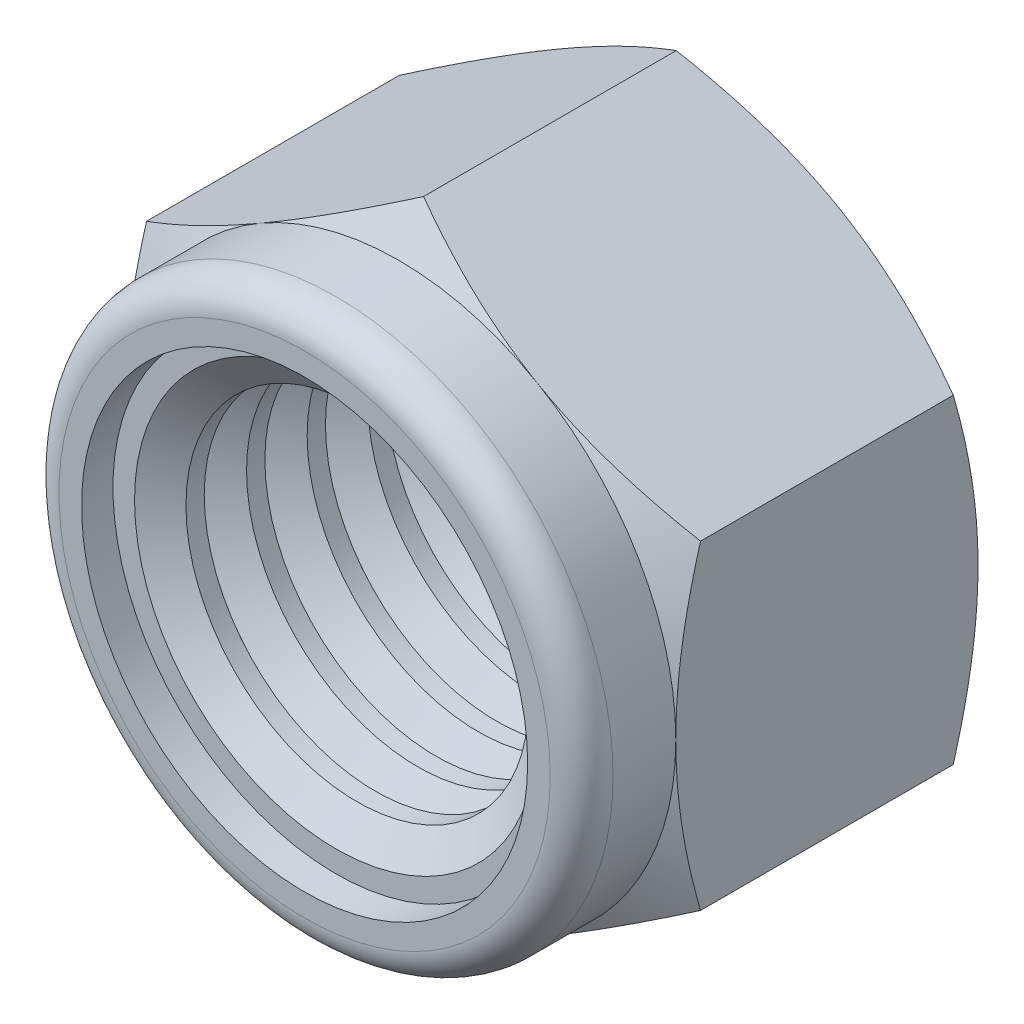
ISO-10303-21;
HEADER;
FILE_DESCRIPTION(('STEP AP214'),'2;1');
FILE_NAME('part.step','',(''),(''),'','','');
FILE_SCHEMA(('AUTOMOTIVE_DESIGN { 1 0 10303 214 1 1 1 1 }'));
ENDSEC;
DATA;
#1=APPLICATION_CONTEXT('core data for automotive mechanical design processes');
#2=APPLICATION_PROTOCOL_DEFINITION('international standard','automotive_design',2000,#1);
#3=PRODUCT_CONTEXT('',#1,'mechanical');
#4=PRODUCT('Part','Part','',(#3));
#5=PRODUCT_RELATED_PRODUCT_CATEGORY('part','',(#4));
#6=PRODUCT_DEFINITION_FORMATION('','',#4);
#7=PRODUCT_DEFINITION_CONTEXT('part definition',#1,'design');
#8=PRODUCT_DEFINITION('design','',#6,#7);
#9=PRODUCT_DEFINITION_SHAPE('','',#8);
#10=(LENGTH_UNIT() NAMED_UNIT(*) SI_UNIT(.MILLI.,.METRE.));
#11=(NAMED_UNIT(*) PLANE_ANGLE_UNIT() SI_UNIT($,.RADIAN.));
#12=(NAMED_UNIT(*) SI_UNIT($,.STERADIAN.) SOLID_ANGLE_UNIT());
#13=UNCERTAINTY_MEASURE_WITH_UNIT(LENGTH_MEASURE(1.E-05),#10,'distance_accuracy_value','');
#14=(GEOMETRIC_REPRESENTATION_CONTEXT(3) GLOBAL_UNCERTAINTY_ASSIGNED_CONTEXT((#13)) GLOBAL_UNIT_ASSIGNED_CONTEXT((#10,
#11,#12)) REPRESENTATION_CONTEXT('',''));
#15=CARTESIAN_POINT('',(0.,0.,0.));
#16=DIRECTION('',(0.,0.,1.));
#17=DIRECTION('',(1.,0.,0.));
#18=AXIS2_PLACEMENT_3D('',#15,#16,#17);
#19=CARTESIAN_POINT('',(0.,0.,-6.));
#20=DIRECTION('',(0.,0.,1.));
#21=DIRECTION('',(1.,0.,0.));
#22=AXIS2_PLACEMENT_3D('',#19,#20,#21);
#23=CYLINDRICAL_SURFACE('',#22,3.4);
#24=CARTESIAN_POINT('',(0.,0.,-5.19118007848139));
#25=DIRECTION('',(0.,0.,-1.));
#26=DIRECTION('',(-1.,0.,0.));
#27=AXIS2_PLACEMENT_3D('',#24,#25,#26);
#28=CIRCLE('',#27,3.4);
#29=CARTESIAN_POINT('',(-3.4,0.,-5.19118007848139));
#30=VERTEX_POINT('',#29);
#31=EDGE_CURVE('E314',#30,#30,#28,.T.);
#32=ORIENTED_EDGE('',*,*,#31,.F.);
#33=EDGE_LOOP('',(#32));
#34=FACE_BOUND('',#33,.T.);
#35=CARTESIAN_POINT('',(0.,0.,-5.55447547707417));
#36=DIRECTION('',(0.,0.,-1.));
#37=DIRECTION('',(-1.,0.,0.));
#38=AXIS2_PLACEMENT_3D('',#35,#36,#37);
#39=CIRCLE('',#38,3.4);
#40=CARTESIAN_POINT('',(-3.4,0.,-5.55447547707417));
#41=VERTEX_POINT('',#40);
#42=EDGE_CURVE('E31',#41,#41,#39,.F.);
#43=ORIENTED_EDGE('',*,*,#42,.F.);
#44=EDGE_LOOP('',(#43));
#45=FACE_BOUND('',#44,.T.);
#46=ADVANCED_FACE('F26',(#34,#45),#23,.F.);
#47=CARTESIAN_POINT('',(0.,0.,-4.35093103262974));
#48=DIRECTION('',(0.,0.,-1.));
#49=DIRECTION('',(-1.,0.,0.));
#50=AXIS2_PLACEMENT_3D('',#47,#48,#49);
#51=CIRCLE('',#50,3.4);
#52=CARTESIAN_POINT('',(-3.4,0.,-4.35093103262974));
#53=VERTEX_POINT('',#52);
#54=EDGE_CURVE('E317',#53,#53,#51,.T.);
#55=ORIENTED_EDGE('',*,*,#54,.T.);
#56=EDGE_LOOP('',(#55));
#57=FACE_BOUND('',#56,.T.);
#58=CARTESIAN_POINT('',(0.,0.,-3.98763563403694));
#59=DIRECTION('',(0.,0.,-1.));
#60=DIRECTION('',(-1.,0.,0.));
#61=AXIS2_PLACEMENT_3D('',#58,#59,#60);
#62=CIRCLE('',#61,3.4);
#63=CARTESIAN_POINT('',(-3.4,0.,-3.98763563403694));
#64=VERTEX_POINT('',#63);
#65=EDGE_CURVE('E305',#64,#64,#62,.T.);
#66=ORIENTED_EDGE('',*,*,#65,.F.);
#67=EDGE_LOOP('',(#66));
#68=FACE_BOUND('',#67,.T.);
#69=ADVANCED_FACE('F321',(#57,#68),#23,.F.);
#70=CARTESIAN_POINT('',(0.,0.,-3.1473865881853));
#71=DIRECTION('',(0.,0.,-1.));
#72=DIRECTION('',(-1.,0.,0.));
#73=AXIS2_PLACEMENT_3D('',#70,#71,#72);
#74=CIRCLE('',#73,3.4);
#75=CARTESIAN_POINT('',(-3.4,0.,-3.1473865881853));
#76=VERTEX_POINT('',#75);
#77=EDGE_CURVE('E308',#76,#76,#74,.T.);
#78=ORIENTED_EDGE('',*,*,#77,.T.);
#79=EDGE_LOOP('',(#78));
#80=FACE_BOUND('',#79,.T.);
#81=CARTESIAN_POINT('',(0.,0.,-2.7840911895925));
#82=DIRECTION('',(0.,0.,-1.));
#83=DIRECTION('',(-1.,0.,0.));
#84=AXIS2_PLACEMENT_3D('',#81,#82,#83);
#85=CIRCLE('',#84,3.4);
#86=CARTESIAN_POINT('',(-3.4,0.,-2.7840911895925));
#87=VERTEX_POINT('',#86);
#88=EDGE_CURVE('E296',#87,#87,#85,.T.);
#89=ORIENTED_EDGE('',*,*,#88,.F.);
#90=EDGE_LOOP('',(#89));
#91=FACE_BOUND('',#90,.T.);
#92=ADVANCED_FACE('F410',(#80,#91),#23,.F.);
#93=CARTESIAN_POINT('',(0.,0.,-1.94384214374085));
#94=DIRECTION('',(0.,0.,-1.));
#95=DIRECTION('',(-1.,0.,0.));
#96=AXIS2_PLACEMENT_3D('',#93,#94,#95);
#97=CIRCLE('',#96,3.4);
#98=CARTESIAN_POINT('',(-3.4,0.,-1.94384214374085));
#99=VERTEX_POINT('',#98);
#100=EDGE_CURVE('E299',#99,#99,#97,.T.);
#101=ORIENTED_EDGE('',*,*,#100,.T.);
#102=EDGE_LOOP('',(#101));
#103=FACE_BOUND('',#102,.T.);
#104=CARTESIAN_POINT('',(0.,0.,-1.58054674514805));
#105=DIRECTION('',(0.,0.,-1.));
#106=DIRECTION('',(-1.,0.,0.));
#107=AXIS2_PLACEMENT_3D('',#104,#105,#106);
#108=CIRCLE('',#107,3.4);
#109=CARTESIAN_POINT('',(-3.4,0.,-1.58054674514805));
#110=VERTEX_POINT('',#109);
#111=EDGE_CURVE('E287',#110,#110,#108,.T.);
#112=ORIENTED_EDGE('',*,*,#111,.F.);
#113=EDGE_LOOP('',(#112));
#114=FACE_BOUND('',#113,.T.);
#115=ADVANCED_FACE('F414',(#103,#114),#23,.F.);
#116=CARTESIAN_POINT('',(0.,0.,-0.740297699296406));
#117=DIRECTION('',(0.,0.,-1.));
#118=DIRECTION('',(-1.,0.,0.));
#119=AXIS2_PLACEMENT_3D('',#116,#117,#118);
#120=CIRCLE('',#119,3.4);
#121=CARTESIAN_POINT('',(-3.4,0.,-0.740297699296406));
#122=VERTEX_POINT('',#121);
#123=EDGE_CURVE('E290',#122,#122,#120,.T.);
#124=ORIENTED_EDGE('',*,*,#123,.T.);
#125=EDGE_LOOP('',(#124));
#126=FACE_BOUND('',#125,.T.);
#127=CARTESIAN_POINT('',(0.,0.,-0.377002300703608));
#128=DIRECTION('',(0.,0.,-1.));
#129=DIRECTION('',(-1.,0.,0.));
#130=AXIS2_PLACEMENT_3D('',#127,#128,#129);
#131=CIRCLE('',#130,3.4);
#132=CARTESIAN_POINT('',(-3.4,0.,-0.377002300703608));
#133=VERTEX_POINT('',#132);
#134=EDGE_CURVE('E278',#133,#133,#131,.T.);
#135=ORIENTED_EDGE('',*,*,#134,.F.);
#136=EDGE_LOOP('',(#135));
#137=FACE_BOUND('',#136,.T.);
#138=ADVANCED_FACE('F417',(#126,#137),#23,.F.);
#139=CARTESIAN_POINT('',(0.,0.,0.463246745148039));
#140=DIRECTION('',(0.,0.,-1.));
#141=DIRECTION('',(-1.,0.,0.));
#142=AXIS2_PLACEMENT_3D('',#139,#140,#141);
#143=CIRCLE('',#142,3.4);
#144=CARTESIAN_POINT('',(-3.4,0.,0.463246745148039));
#145=VERTEX_POINT('',#144);
#146=EDGE_CURVE('E281',#145,#145,#143,.T.);
#147=ORIENTED_EDGE('',*,*,#146,.T.);
#148=EDGE_LOOP('',(#147));
#149=FACE_BOUND('',#148,.T.);
#150=CARTESIAN_POINT('',(0.,0.,0.826542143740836));
#151=DIRECTION('',(0.,0.,-1.));
#152=DIRECTION('',(-1.,0.,0.));
#153=AXIS2_PLACEMENT_3D('',#150,#151,#152);
#154=CIRCLE('',#153,3.4);
#155=CARTESIAN_POINT('',(-3.4,0.,0.826542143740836));
#156=VERTEX_POINT('',#155);
#157=EDGE_CURVE('E272',#156,#156,#154,.T.);
#158=ORIENTED_EDGE('',*,*,#157,.F.);
#159=EDGE_LOOP('',(#158));
#160=FACE_BOUND('',#159,.T.);
#161=ADVANCED_FACE('F339',(#149,#160),#23,.F.);
#162=CARTESIAN_POINT('',(-11.,0.,-6.));
#163=DIRECTION('',(0.,0.,1.));
#164=DIRECTION('',(1.,0.,0.));
#165=AXIS2_PLACEMENT_3D('',#162,#163,#164);
#166=PLANE('',#165);
#167=CARTESIAN_POINT('',(0.,0.,-6.));
#168=DIRECTION('',(0.,0.,1.));
#169=DIRECTION('',(1.,0.,0.));
#170=AXIS2_PLACEMENT_3D('',#167,#168,#169);
#171=CIRCLE('',#170,5.5);
#172=CARTESIAN_POINT('',(5.5,0.,-6.));
#173=VERTEX_POINT('',#172);
#174=CARTESIAN_POINT('',(2.75000000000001,4.76313972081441,-6.));
#175=VERTEX_POINT('',#174);
#176=EDGE_CURVE('E205',#173,#175,#171,.T.);
#177=ORIENTED_EDGE('',*,*,#176,.F.);
#178=CARTESIAN_POINT('',(0.,0.,-6.));
#179=DIRECTION('',(0.,0.,1.));
#180=DIRECTION('',(1.,0.,0.));
#181=AXIS2_PLACEMENT_3D('',#178,#179,#180);
#182=CIRCLE('',#181,5.5);
#183=CARTESIAN_POINT('',(2.75,-4.76313972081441,-6.));
#184=VERTEX_POINT('',#183);
#185=EDGE_CURVE('E245',#173,#184,#182,.F.);
#186=ORIENTED_EDGE('',*,*,#185,.T.);
#187=CARTESIAN_POINT('',(-2.75000000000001,-4.76313972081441,-6.));
#188=VERTEX_POINT('',#187);
#189=EDGE_CURVE('E247',#184,#188,#182,.F.);
#190=ORIENTED_EDGE('',*,*,#189,.T.);
#191=CARTESIAN_POINT('',(-5.5,0.,-6.));
#192=VERTEX_POINT('',#191);
#193=EDGE_CURVE('E719',#188,#192,#182,.F.);
#194=ORIENTED_EDGE('',*,*,#193,.T.);
#195=CARTESIAN_POINT('',(-2.75,4.76313972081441,-6.));
#196=VERTEX_POINT('',#195);
#197=EDGE_CURVE('E721',#192,#196,#182,.F.);
#198=ORIENTED_EDGE('',*,*,#197,.T.);
#199=EDGE_CURVE('E229',#196,#175,#182,.F.);
#200=ORIENTED_EDGE('',*,*,#199,.T.);
#201=EDGE_LOOP('',(#177,#186,#190,#194,#198,#200));
#202=FACE_BOUND('',#201,.T.);
#203=CARTESIAN_POINT('',(0.,0.,-6.));
#204=DIRECTION('',(0.,0.,1.));
#205=DIRECTION('',(1.,0.,0.));
#206=AXIS2_PLACEMENT_3D('',#203,#204,#205);
#207=CIRCLE('',#206,4.);
#208=CARTESIAN_POINT('',(4.,0.,-6.));
#209=VERTEX_POINT('',#208);
#210=EDGE_CURVE('E150',#209,#209,#207,.F.);
#211=ORIENTED_EDGE('',*,*,#210,.F.);
#212=EDGE_LOOP('',(#211));
#213=FACE_BOUND('',#212,.T.);
#214=ADVANCED_FACE('F211',(#202,#213),#166,.F.);
#215=CARTESIAN_POINT('',(0.,6.35085296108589,-6.));
#216=DIRECTION('',(-0.5,0.866025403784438,0.));
#217=DIRECTION('',(-0.866025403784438,-0.500000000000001,0.));
#218=AXIS2_PLACEMENT_3D('',#215,#216,#217);
#219=PLANE('',#218);
#220=DIRECTION('',(0.,0.,1.));
#221=VECTOR('',#220,1.);
#222=CARTESIAN_POINT('',(-5.5,3.17542648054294,-6.));
#223=LINE('',#222,#221);
#224=CARTESIAN_POINT('',(-5.5,3.17542648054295,-5.50875981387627));
#225=VERTEX_POINT('',#224);
#226=CARTESIAN_POINT('',(-5.5,3.17542648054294,-0.491240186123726));
#227=VERTEX_POINT('',#226);
#228=EDGE_CURVE('E241',#225,#227,#223,.T.);
#229=ORIENTED_EDGE('',*,*,#228,.T.);
#230=CARTESIAN_POINT('',(-5.5002,3.1753110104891,-0.491306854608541));
#231=CARTESIAN_POINT('',(-5.37930342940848,3.24511067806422,-0.451013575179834));
#232=CARTESIAN_POINT('',(-5.25795609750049,3.31517059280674,-0.412548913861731));
#233=CARTESIAN_POINT('',(-5.01427595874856,3.45585938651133,-0.339780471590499));
#234=CARTESIAN_POINT('',(-4.89194275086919,3.52648849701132,-0.305478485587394));
#235=CARTESIAN_POINT('',(-4.52298438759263,3.7395067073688,-0.209489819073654));
#236=CARTESIAN_POINT('',(-4.27490281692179,3.8827366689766,-0.154892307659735));
#237=CARTESIAN_POINT('',(-3.90365325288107,4.09707770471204,-0.0908698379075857));
#238=CARTESIAN_POINT('',(-3.78159453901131,4.16754833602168,-0.0726315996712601));
#239=CARTESIAN_POINT('',(-3.5369255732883,4.30880802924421,-0.0420485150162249));
#240=CARTESIAN_POINT('',(-3.41431537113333,4.37959706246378,-0.0297031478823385));
#241=CARTESIAN_POINT('',(-3.16888200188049,4.52129808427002,-0.0112204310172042));
#242=CARTESIAN_POINT('',(-3.04605923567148,4.59220984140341,-0.00507603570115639));
#243=CARTESIAN_POINT('',(-2.80030700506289,4.73409495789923,0.000879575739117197));
#244=CARTESIAN_POINT('',(-2.6773775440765,4.80506831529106,0.000690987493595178));
#245=CARTESIAN_POINT('',(-2.34058591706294,4.99951505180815,-0.00853091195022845));
#246=CARTESIAN_POINT('',(-2.12683398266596,5.12292478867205,-0.0240139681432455));
#247=CARTESIAN_POINT('',(-1.70074984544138,5.36892457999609,-0.0731121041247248));
#248=CARTESIAN_POINT('',(-1.48841914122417,5.49151376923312,-0.106743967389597));
#249=CARTESIAN_POINT('',(-1.06147742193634,5.73800868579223,-0.190814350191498));
#250=CARTESIAN_POINT('',(-0.84692028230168,5.86188330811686,-0.241609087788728));
#251=CARTESIAN_POINT('',(-0.421005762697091,6.10778517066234,-0.356892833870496));
#252=CARTESIAN_POINT('',(-0.209642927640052,6.2298155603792,-0.421354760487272));
#253=CARTESIAN_POINT('',(0.000200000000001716,6.35096843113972,-0.491306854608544));
#254=B_SPLINE_CURVE_WITH_KNOTS('',3,(#230,#231,#232,#233,#234,#235,#236,#237,#238,#239,#240,
#241,#242,#243,#244,#245,#246,#247,#248,#249,#250,#251,#252,#253),.UNSPECIFIED.,.F.,.F.,(4,2,2,
2,2,2,2,2,2,2,2,4),(0.,0.435859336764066,0.871905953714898,1.74581116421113,2.17206086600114,
2.59827289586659,3.02400011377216,3.44971418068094,4.19085033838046,4.93267305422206,
5.69094899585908,6.44773620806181),.UNSPECIFIED.);
#255=CARTESIAN_POINT('',(-2.75,4.76313972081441,0.));
#256=VERTEX_POINT('',#255);
#257=EDGE_CURVE('E53',#227,#256,#254,.T.);
#258=ORIENTED_EDGE('',*,*,#257,.T.);
#259=CARTESIAN_POINT('',(0.,6.35085296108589,-0.491240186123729));
#260=VERTEX_POINT('',#259);
#261=EDGE_CURVE('E132',#256,#260,#254,.T.);
#262=ORIENTED_EDGE('',*,*,#261,.T.);
#263=DIRECTION('',(0.,0.,1.));
#264=VECTOR('',#263,1.);
#265=CARTESIAN_POINT('',(0.,6.35085296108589,-6.));
#266=LINE('',#265,#264);
#267=CARTESIAN_POINT('',(0.,6.35085296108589,-5.50875981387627));
#268=VERTEX_POINT('',#267);
#269=EDGE_CURVE('E129',#268,#260,#266,.T.);
#270=ORIENTED_EDGE('',*,*,#269,.F.);
#271=CARTESIAN_POINT('',(-5.5002,3.1753110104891,-5.50869314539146));
#272=CARTESIAN_POINT('',(-5.37930342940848,3.24511067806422,-5.54898642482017));
#273=CARTESIAN_POINT('',(-5.25795609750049,3.31517059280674,-5.58745108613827));
#274=CARTESIAN_POINT('',(-5.01427595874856,3.45585938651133,-5.6602195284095));
#275=CARTESIAN_POINT('',(-4.89194275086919,3.52648849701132,-5.69452151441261));
#276=CARTESIAN_POINT('',(-4.52298438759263,3.7395067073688,-5.79051018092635));
#277=CARTESIAN_POINT('',(-4.27490281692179,3.8827366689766,-5.84510769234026));
#278=CARTESIAN_POINT('',(-3.90365325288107,4.09707770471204,-5.90913016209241));
#279=CARTESIAN_POINT('',(-3.78159453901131,4.16754833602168,-5.92736840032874));
#280=CARTESIAN_POINT('',(-3.5369255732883,4.30880802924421,-5.95795148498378));
#281=CARTESIAN_POINT('',(-3.41431537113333,4.37959706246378,-5.97029685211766));
#282=CARTESIAN_POINT('',(-3.16888200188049,4.52129808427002,-5.9887795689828));
#283=CARTESIAN_POINT('',(-3.04605923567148,4.59220984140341,-5.99492396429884));
#284=CARTESIAN_POINT('',(-2.80030700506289,4.73409495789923,-6.00087957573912));
#285=CARTESIAN_POINT('',(-2.6773775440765,4.80506831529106,-6.00069098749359));
#286=CARTESIAN_POINT('',(-2.34058591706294,4.99951505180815,-5.99146908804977));
#287=CARTESIAN_POINT('',(-2.12683398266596,5.12292478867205,-5.97598603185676));
#288=CARTESIAN_POINT('',(-1.70074984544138,5.36892457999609,-5.92688789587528));
#289=CARTESIAN_POINT('',(-1.48841914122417,5.49151376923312,-5.8932560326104));
#290=CARTESIAN_POINT('',(-1.06147742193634,5.73800868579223,-5.8091856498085));
#291=CARTESIAN_POINT('',(-0.84692028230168,5.86188330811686,-5.75839091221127));
#292=CARTESIAN_POINT('',(-0.42100576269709,6.10778517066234,-5.6431071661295));
#293=CARTESIAN_POINT('',(-0.209642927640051,6.2298155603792,-5.57864523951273));
#294=CARTESIAN_POINT('',(0.000200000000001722,6.35096843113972,-5.50869314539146));
#295=B_SPLINE_CURVE_WITH_KNOTS('',3,(#271,#272,#273,#274,#275,#276,#277,#278,#279,#280,#281,
#282,#283,#284,#285,#286,#287,#288,#289,#290,#291,#292,#293,#294),.UNSPECIFIED.,.F.,.F.,(4,2,2,
2,2,2,2,2,2,2,2,4),(0.,0.435859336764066,0.871905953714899,1.74581116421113,2.17206086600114,
2.59827289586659,3.02400011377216,3.44971418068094,4.19085033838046,4.93267305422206,
5.69094899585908,6.44773620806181),.UNSPECIFIED.);
#296=EDGE_CURVE('E244',#196,#268,#295,.T.);
#297=ORIENTED_EDGE('',*,*,#296,.F.);
#298=EDGE_CURVE('E223',#225,#196,#295,.T.);
#299=ORIENTED_EDGE('',*,*,#298,.F.);
#300=EDGE_LOOP('',(#229,#258,#262,#270,#297,#299));
#301=FACE_BOUND('',#300,.T.);
#302=ADVANCED_FACE('F28',(#301),#219,.T.);
#303=CARTESIAN_POINT('',(5.5,3.17542648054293,-6.));
#304=DIRECTION('',(0.500000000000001,0.866025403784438,0.));
#305=DIRECTION('',(-0.866025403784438,0.500000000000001,0.));
#306=AXIS2_PLACEMENT_3D('',#303,#304,#305);
#307=PLANE('',#306);
#308=ORIENTED_EDGE('',*,*,#269,.T.);
#309=CARTESIAN_POINT('',(-0.000199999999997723,6.35096843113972,-0.491306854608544));
#310=CARTESIAN_POINT('',(0.120696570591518,6.28116876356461,-0.451013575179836));
#311=CARTESIAN_POINT('',(0.242043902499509,6.21110884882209,-0.412548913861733));
#312=CARTESIAN_POINT('',(0.485724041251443,6.07042005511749,-0.339780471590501));
#313=CARTESIAN_POINT('',(0.608057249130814,5.99979094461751,-0.305478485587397));
#314=CARTESIAN_POINT('',(0.97701561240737,5.78677273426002,-0.209489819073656));
#315=CARTESIAN_POINT('',(1.22509718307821,5.64354277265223,-0.154892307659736));
#316=CARTESIAN_POINT('',(1.59634674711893,5.42920173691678,-0.0908698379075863));
#317=CARTESIAN_POINT('',(1.71840546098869,5.35873110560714,-0.0726315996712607));
#318=CARTESIAN_POINT('',(1.9630744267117,5.21747141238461,-0.0420485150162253));
#319=CARTESIAN_POINT('',(2.08568462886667,5.14668237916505,-0.0297031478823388));
#320=CARTESIAN_POINT('',(2.33111799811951,5.0049813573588,-0.0112204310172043));
#321=CARTESIAN_POINT('',(2.45394076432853,4.93406960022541,-0.00507603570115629));
#322=CARTESIAN_POINT('',(2.69969299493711,4.79218448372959,0.000879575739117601));
#323=CARTESIAN_POINT('',(2.8226224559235,4.72121112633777,0.000690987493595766));
#324=CARTESIAN_POINT('',(3.15941408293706,4.52676438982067,-0.00853091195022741));
#325=CARTESIAN_POINT('',(3.37316601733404,4.40335465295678,-0.0240139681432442));
#326=CARTESIAN_POINT('',(3.79925015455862,4.15735486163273,-0.0731121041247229));
#327=CARTESIAN_POINT('',(4.01158085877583,4.0347656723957,-0.106743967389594));
#328=CARTESIAN_POINT('',(4.43852257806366,3.78827075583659,-0.190814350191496));
#329=CARTESIAN_POINT('',(4.65307971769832,3.66439613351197,-0.241609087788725));
#330=CARTESIAN_POINT('',(5.07899423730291,3.41849427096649,-0.356892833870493));
#331=CARTESIAN_POINT('',(5.29035707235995,3.29646388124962,-0.421354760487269));
#332=CARTESIAN_POINT('',(5.5002,3.1753110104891,-0.49130685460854));
#333=B_SPLINE_CURVE_WITH_KNOTS('',3,(#309,#310,#311,#312,#313,#314,#315,#316,#317,#318,#319,
#320,#321,#322,#323,#324,#325,#326,#327,#328,#329,#330,#331,#332),.UNSPECIFIED.,.F.,.F.,(4,2,2,
2,2,2,2,2,2,2,2,4),(0.,0.435859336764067,0.8719059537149,1.74581116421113,2.17206086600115,
2.5982728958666,3.02400011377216,3.44971418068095,4.19085033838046,4.93267305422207,
5.69094899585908,6.44773620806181),.UNSPECIFIED.);
#334=CARTESIAN_POINT('',(2.75000000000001,4.76313972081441,0.));
#335=VERTEX_POINT('',#334);
#336=EDGE_CURVE('E121',#260,#335,#333,.T.);
#337=ORIENTED_EDGE('',*,*,#336,.T.);
#338=CARTESIAN_POINT('',(5.5,3.17542648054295,-0.491240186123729));
#339=VERTEX_POINT('',#338);
#340=EDGE_CURVE('E125',#335,#339,#333,.T.);
#341=ORIENTED_EDGE('',*,*,#340,.T.);
#342=DIRECTION('',(0.,0.,1.));
#343=VECTOR('',#342,1.);
#344=CARTESIAN_POINT('',(5.5,3.17542648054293,-6.));
#345=LINE('',#344,#343);
#346=CARTESIAN_POINT('',(5.5,3.17542648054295,-5.50875981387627));
#347=VERTEX_POINT('',#346);
#348=EDGE_CURVE('E230',#347,#339,#345,.T.);
#349=ORIENTED_EDGE('',*,*,#348,.F.);
#350=CARTESIAN_POINT('',(-0.000199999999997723,6.35096843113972,-5.50869314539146));
#351=CARTESIAN_POINT('',(0.120696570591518,6.28116876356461,-5.54898642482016));
#352=CARTESIAN_POINT('',(0.242043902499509,6.21110884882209,-5.58745108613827));
#353=CARTESIAN_POINT('',(0.485724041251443,6.07042005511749,-5.6602195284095));
#354=CARTESIAN_POINT('',(0.608057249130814,5.99979094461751,-5.6945215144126));
#355=CARTESIAN_POINT('',(0.977015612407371,5.78677273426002,-5.79051018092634));
#356=CARTESIAN_POINT('',(1.22509718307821,5.64354277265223,-5.84510769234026));
#357=CARTESIAN_POINT('',(1.59634674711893,5.42920173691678,-5.90913016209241));
#358=CARTESIAN_POINT('',(1.71840546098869,5.35873110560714,-5.92736840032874));
#359=CARTESIAN_POINT('',(1.9630744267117,5.21747141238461,-5.95795148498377));
#360=CARTESIAN_POINT('',(2.08568462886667,5.14668237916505,-5.97029685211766));
#361=CARTESIAN_POINT('',(2.33111799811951,5.0049813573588,-5.9887795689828));
#362=CARTESIAN_POINT('',(2.45394076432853,4.93406960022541,-5.99492396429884));
#363=CARTESIAN_POINT('',(2.69969299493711,4.79218448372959,-6.00087957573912));
#364=CARTESIAN_POINT('',(2.8226224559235,4.72121112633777,-6.0006909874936));
#365=CARTESIAN_POINT('',(3.15941408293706,4.52676438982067,-5.99146908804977));
#366=CARTESIAN_POINT('',(3.37316601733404,4.40335465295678,-5.97598603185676));
#367=CARTESIAN_POINT('',(3.79925015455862,4.15735486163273,-5.92688789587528));
#368=CARTESIAN_POINT('',(4.01158085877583,4.0347656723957,-5.89325603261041));
#369=CARTESIAN_POINT('',(4.43852257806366,3.78827075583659,-5.8091856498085));
#370=CARTESIAN_POINT('',(4.65307971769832,3.66439613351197,-5.75839091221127));
#371=CARTESIAN_POINT('',(5.07899423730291,3.41849427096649,-5.64310716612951));
#372=CARTESIAN_POINT('',(5.29035707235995,3.29646388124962,-5.57864523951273));
#373=CARTESIAN_POINT('',(5.5002,3.1753110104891,-5.50869314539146));
#374=B_SPLINE_CURVE_WITH_KNOTS('',3,(#350,#351,#352,#353,#354,#355,#356,#357,#358,#359,#360,
#361,#362,#363,#364,#365,#366,#367,#368,#369,#370,#371,#372,#373),.UNSPECIFIED.,.F.,.F.,(4,2,2,
2,2,2,2,2,2,2,2,4),(0.,0.435859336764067,0.8719059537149,1.74581116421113,2.17206086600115,
2.5982728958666,3.02400011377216,3.44971418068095,4.19085033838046,4.93267305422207,
5.69094899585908,6.44773620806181),.UNSPECIFIED.);
#375=EDGE_CURVE('E215',#175,#347,#374,.T.);
#376=ORIENTED_EDGE('',*,*,#375,.F.);
#377=EDGE_CURVE('E221',#268,#175,#374,.T.);
#378=ORIENTED_EDGE('',*,*,#377,.F.);
#379=EDGE_LOOP('',(#308,#337,#341,#349,#376,#378));
#380=FACE_BOUND('',#379,.T.);
#381=ADVANCED_FACE('F123',(#380),#307,.T.);
#382=CARTESIAN_POINT('',(5.5,3.17542648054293,-6.));
#383=DIRECTION('',(-1.,0.,0.));
#384=DIRECTION('',(0.,-1.,0.));
#385=AXIS2_PLACEMENT_3D('',#382,#383,#384);
#386=PLANE('',#385);
#387=CARTESIAN_POINT('',(5.5,-8.42169898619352,-2.63189687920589));
#388=CARTESIAN_POINT('',(5.5,-8.18021788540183,-2.51519987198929));
#389=CARTESIAN_POINT('',(5.5,-7.93816584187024,-2.39966293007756));
#390=CARTESIAN_POINT('',(5.5,-7.45261116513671,-2.17157207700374));
#391=CARTESIAN_POINT('',(5.5,-7.20910828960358,-2.05901868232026));
#392=CARTESIAN_POINT('',(5.5,-6.71902786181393,-1.8369648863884));
#393=CARTESIAN_POINT('',(5.5,-6.47244068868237,-1.72748564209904));
#394=CARTESIAN_POINT('',(5.5,-5.97723959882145,-1.5132295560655));
#395=CARTESIAN_POINT('',(5.5,-5.72862578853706,-1.40845246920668));
#396=CARTESIAN_POINT('',(5.5,-5.22588973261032,-1.20360714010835));
#397=CARTESIAN_POINT('',(5.5,-4.97173733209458,-1.10361250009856));
#398=CARTESIAN_POINT('',(5.5,-4.46043458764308,-0.91145483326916));
#399=CARTESIAN_POINT('',(5.5,-4.2032839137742,-0.819292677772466));
#400=CARTESIAN_POINT('',(5.5,-3.68610458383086,-0.645276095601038));
#401=CARTESIAN_POINT('',(5.5,-3.42608337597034,-0.563399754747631));
#402=CARTESIAN_POINT('',(5.5,-2.90234172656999,-0.412614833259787));
#403=CARTESIAN_POINT('',(5.5,-2.63862248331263,-0.343702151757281));
#404=CARTESIAN_POINT('',(5.5,-2.10731734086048,-0.222186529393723));
#405=CARTESIAN_POINT('',(5.5,-1.83973043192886,-0.169587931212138));
#406=CARTESIAN_POINT('',(5.5,-1.30129295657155,-0.0842551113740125));
#407=CARTESIAN_POINT('',(5.5,-1.03044238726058,-0.0515209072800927));
#408=CARTESIAN_POINT('',(5.5,-0.623735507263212,-0.0194163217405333));
#409=CARTESIAN_POINT('',(5.5,-0.488515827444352,-0.0115459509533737));
#410=CARTESIAN_POINT('',(5.5,-0.21785830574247,-0.00153499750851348));
#411=CARTESIAN_POINT('',(5.5,-0.0824204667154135,0.000605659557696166));
#412=CARTESIAN_POINT('',(5.5,0.188383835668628,-0.000900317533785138));
#413=CARTESIAN_POINT('',(5.5,0.323750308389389,-0.00454532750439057));
#414=CARTESIAN_POINT('',(5.5,0.594212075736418,-0.017530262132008));
#415=CARTESIAN_POINT('',(5.5,0.729307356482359,-0.0268704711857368));
#416=CARTESIAN_POINT('',(5.5,1.05673660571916,-0.0562158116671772));
#417=CARTESIAN_POINT('',(5.5,1.24881895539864,-0.0790746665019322));
#418=CARTESIAN_POINT('',(5.5,1.63151179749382,-0.135037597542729));
#419=CARTESIAN_POINT('',(5.5,1.82212187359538,-0.168144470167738));
#420=CARTESIAN_POINT('',(5.5,2.20171285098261,-0.243429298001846));
#421=CARTESIAN_POINT('',(5.5,2.39069203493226,-0.285615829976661));
#422=CARTESIAN_POINT('',(5.5,2.76670607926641,-0.377772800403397));
#423=CARTESIAN_POINT('',(5.5,2.95374112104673,-0.427742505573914));
#424=CARTESIAN_POINT('',(5.5,3.330473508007,-0.53557656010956));
#425=CARTESIAN_POINT('',(5.5,3.5201237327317,-0.593604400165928));
#426=CARTESIAN_POINT('',(5.5,3.89741957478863,-0.715393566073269));
#427=CARTESIAN_POINT('',(5.5,4.08506647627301,-0.779150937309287));
#428=CARTESIAN_POINT('',(5.5,4.45760271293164,-0.911082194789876));
#429=CARTESIAN_POINT('',(5.5,4.64250162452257,-0.979229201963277));
#430=CARTESIAN_POINT('',(5.5,5.01086488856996,-1.11952305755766));
#431=CARTESIAN_POINT('',(5.5,5.19432862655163,-1.191671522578));
#432=CARTESIAN_POINT('',(5.5,5.3771258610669,-1.26542488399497));
#433=B_SPLINE_CURVE_WITH_KNOTS('',3,(#387,#388,#389,#390,#391,#392,#393,#394,#395,#396,#397,
#398,#399,#400,#401,#402,#403,#404,#405,#406,#407,#408,#409,#410,#411,#412,#413,#414,#415,#416,
#417,#418,#419,#420,#421,#422,#423,#424,#425,#426,#427,#428,#429,#430,#431,#432),.UNSPECIFIED.,
.F.,.F.,(4,2,2,2,2,2,2,2,2,2,2,2,2,2,2,2,2,2,2,2,2,2,4),(0.,0.804611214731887,1.60936081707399,
2.41871567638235,3.22802829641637,4.04727676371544,4.86661624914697,5.68417938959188,
6.50148346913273,7.31900492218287,8.13652709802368,8.54276955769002,8.94900674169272,
9.35512990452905,9.76127334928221,10.3412634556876,10.9214119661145,11.5021109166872,
12.0827551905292,12.6776323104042,13.2721019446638,13.8632255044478,14.4545896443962),.UNSPECIFIED.);
#434=CARTESIAN_POINT('',(5.5,-3.17542648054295,-0.491240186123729));
#435=VERTEX_POINT('',#434);
#436=CARTESIAN_POINT('',(5.5,0.,0.));
#437=VERTEX_POINT('',#436);
#438=EDGE_CURVE('E191',#435,#437,#433,.T.);
#439=ORIENTED_EDGE('',*,*,#438,.F.);
#440=DIRECTION('',(0.,0.,1.));
#441=VECTOR('',#440,1.);
#442=CARTESIAN_POINT('',(5.5,-3.17542648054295,-6.));
#443=LINE('',#442,#441);
#444=CARTESIAN_POINT('',(5.5,-3.17542648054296,-5.50875981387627));
#445=VERTEX_POINT('',#444);
#446=EDGE_CURVE('E232',#445,#435,#443,.T.);
#447=ORIENTED_EDGE('',*,*,#446,.F.);
#448=CARTESIAN_POINT('',(5.5,-8.42169898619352,-3.36810312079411));
#449=CARTESIAN_POINT('',(5.5,-8.18021788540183,-3.48480012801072));
#450=CARTESIAN_POINT('',(5.5,-7.93816584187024,-3.60033706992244));
#451=CARTESIAN_POINT('',(5.5,-7.45261116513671,-3.82842792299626));
#452=CARTESIAN_POINT('',(5.5,-7.20910828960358,-3.94098131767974));
#453=CARTESIAN_POINT('',(5.5,-6.71902786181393,-4.1630351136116));
#454=CARTESIAN_POINT('',(5.5,-6.47244068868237,-4.27251435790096));
#455=CARTESIAN_POINT('',(5.5,-5.97723959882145,-4.4867704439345));
#456=CARTESIAN_POINT('',(5.5,-5.72862578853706,-4.59154753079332));
#457=CARTESIAN_POINT('',(5.5,-5.22588973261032,-4.79639285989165));
#458=CARTESIAN_POINT('',(5.5,-4.97173733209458,-4.89638749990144));
#459=CARTESIAN_POINT('',(5.5,-4.46043458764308,-5.08854516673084));
#460=CARTESIAN_POINT('',(5.5,-4.2032839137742,-5.18070732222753));
#461=CARTESIAN_POINT('',(5.5,-3.68610458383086,-5.35472390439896));
#462=CARTESIAN_POINT('',(5.5,-3.42608337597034,-5.43660024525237));
#463=CARTESIAN_POINT('',(5.5,-2.90234172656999,-5.58738516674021));
#464=CARTESIAN_POINT('',(5.5,-2.63862248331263,-5.65629784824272));
#465=CARTESIAN_POINT('',(5.5,-2.10731734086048,-5.77781347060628));
#466=CARTESIAN_POINT('',(5.5,-1.83973043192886,-5.83041206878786));
#467=CARTESIAN_POINT('',(5.5,-1.30129295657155,-5.91574488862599));
#468=CARTESIAN_POINT('',(5.5,-1.03044238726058,-5.94847909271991));
#469=CARTESIAN_POINT('',(5.5,-0.623735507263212,-5.98058367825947));
#470=CARTESIAN_POINT('',(5.5,-0.488515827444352,-5.98845404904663));
#471=CARTESIAN_POINT('',(5.5,-0.217858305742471,-5.99846500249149));
#472=CARTESIAN_POINT('',(5.5,-0.082420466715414,-6.0006056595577));
#473=CARTESIAN_POINT('',(5.5,0.188383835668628,-5.99909968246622));
#474=CARTESIAN_POINT('',(5.5,0.323750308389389,-5.99545467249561));
#475=CARTESIAN_POINT('',(5.5,0.594212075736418,-5.98246973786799));
#476=CARTESIAN_POINT('',(5.5,0.72930735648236,-5.97312952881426));
#477=CARTESIAN_POINT('',(5.5,1.05673660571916,-5.94378418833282));
#478=CARTESIAN_POINT('',(5.5,1.24881895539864,-5.92092533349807));
#479=CARTESIAN_POINT('',(5.5,1.63151179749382,-5.86496240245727));
#480=CARTESIAN_POINT('',(5.5,1.82212187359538,-5.83185552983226));
#481=CARTESIAN_POINT('',(5.5,2.2017128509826,-5.75657070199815));
#482=CARTESIAN_POINT('',(5.5,2.39069203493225,-5.71438417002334));
#483=CARTESIAN_POINT('',(5.5,2.76670607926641,-5.6222271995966));
#484=CARTESIAN_POINT('',(5.5,2.95374112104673,-5.57225749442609));
#485=CARTESIAN_POINT('',(5.5,3.330473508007,-5.46442343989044));
#486=CARTESIAN_POINT('',(5.5,3.5201237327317,-5.40639559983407));
#487=CARTESIAN_POINT('',(5.5,3.89741957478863,-5.28460643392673));
#488=CARTESIAN_POINT('',(5.5,4.08506647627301,-5.22084906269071));
#489=CARTESIAN_POINT('',(5.5,4.45760271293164,-5.08891780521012));
#490=CARTESIAN_POINT('',(5.5,4.64250162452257,-5.02077079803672));
#491=CARTESIAN_POINT('',(5.5,5.01086488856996,-4.88047694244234));
#492=CARTESIAN_POINT('',(5.5,5.19432862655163,-4.808328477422));
#493=CARTESIAN_POINT('',(5.5,5.3771258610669,-4.73457511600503));
#494=B_SPLINE_CURVE_WITH_KNOTS('',3,(#448,#449,#450,#451,#452,#453,#454,#455,#456,#457,#458,
#459,#460,#461,#462,#463,#464,#465,#466,#467,#468,#469,#470,#471,#472,#473,#474,#475,#476,#477,
#478,#479,#480,#481,#482,#483,#484,#485,#486,#487,#488,#489,#490,#491,#492,#493),.UNSPECIFIED.,
.F.,.F.,(4,2,2,2,2,2,2,2,2,2,2,2,2,2,2,2,2,2,2,2,2,2,4),(0.,0.804611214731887,1.609360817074,
2.41871567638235,3.22802829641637,4.04727676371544,4.86661624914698,5.68417938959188,
6.50148346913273,7.31900492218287,8.13652709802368,8.54276955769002,8.94900674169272,
9.35512990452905,9.76127334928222,10.3412634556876,10.9214119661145,11.5021109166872,
12.0827551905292,12.6776323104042,13.2721019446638,13.8632255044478,14.4545896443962),.UNSPECIFIED.);
#495=EDGE_CURVE('E667',#445,#173,#494,.T.);
#496=ORIENTED_EDGE('',*,*,#495,.T.);
#497=EDGE_CURVE('E222',#173,#347,#494,.T.);
#498=ORIENTED_EDGE('',*,*,#497,.T.);
#499=ORIENTED_EDGE('',*,*,#348,.T.);
#500=EDGE_CURVE('E139',#437,#339,#433,.T.);
#501=ORIENTED_EDGE('',*,*,#500,.F.);
#502=EDGE_LOOP('',(#439,#447,#496,#498,#499,#501));
#503=FACE_BOUND('',#502,.T.);
#504=ADVANCED_FACE('F210',(#503),#386,.F.);
#505=CARTESIAN_POINT('',(0.,-6.3508529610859,-6.));
#506=DIRECTION('',(0.500000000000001,-0.866025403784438,0.));
#507=DIRECTION('',(0.866025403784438,0.500000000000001,0.));
#508=AXIS2_PLACEMENT_3D('',#505,#506,#507);
#509=PLANE('',#508);
#510=ORIENTED_EDGE('',*,*,#446,.T.);
#511=CARTESIAN_POINT('',(5.5002,-3.17531101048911,-0.491306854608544));
#512=CARTESIAN_POINT('',(5.37930342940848,-3.24511067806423,-0.451013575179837));
#513=CARTESIAN_POINT('',(5.25795609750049,-3.31517059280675,-0.412548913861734));
#514=CARTESIAN_POINT('',(5.01427595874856,-3.45585938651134,-0.339780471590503));
#515=CARTESIAN_POINT('',(4.89194275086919,-3.52648849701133,-0.305478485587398));
#516=CARTESIAN_POINT('',(4.52298438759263,-3.73950670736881,-0.209489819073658));
#517=CARTESIAN_POINT('',(4.27490281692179,-3.88273666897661,-0.15489230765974));
#518=CARTESIAN_POINT('',(3.90365325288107,-4.09707770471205,-0.0908698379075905));
#519=CARTESIAN_POINT('',(3.78159453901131,-4.16754833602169,-0.0726315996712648));
#520=CARTESIAN_POINT('',(3.5369255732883,-4.30880802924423,-0.0420485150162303));
#521=CARTESIAN_POINT('',(3.41431537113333,-4.37959706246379,-0.0297031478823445));
#522=CARTESIAN_POINT('',(3.16888200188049,-4.52129808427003,-0.0112204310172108));
#523=CARTESIAN_POINT('',(3.04605923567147,-4.59220984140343,-0.00507603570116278));
#524=CARTESIAN_POINT('',(2.80030700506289,-4.73409495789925,0.000879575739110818));
#525=CARTESIAN_POINT('',(2.6773775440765,-4.80506831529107,0.000690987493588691));
#526=CARTESIAN_POINT('',(2.34058591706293,-4.99951505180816,-0.00853091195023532));
#527=CARTESIAN_POINT('',(2.12683398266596,-5.12292478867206,-0.0240139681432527));
#528=CARTESIAN_POINT('',(1.70074984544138,-5.3689245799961,-0.0731121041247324));
#529=CARTESIAN_POINT('',(1.48841914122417,-5.49151376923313,-0.106743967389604));
#530=CARTESIAN_POINT('',(1.06147742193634,-5.73800868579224,-0.190814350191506));
#531=CARTESIAN_POINT('',(0.846920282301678,-5.86188330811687,-0.241609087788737));
#532=CARTESIAN_POINT('',(0.42100576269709,-6.10778517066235,-0.356892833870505));
#533=CARTESIAN_POINT('',(0.209642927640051,-6.22981556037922,-0.42135476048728));
#534=CARTESIAN_POINT('',(-0.000200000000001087,-6.35096843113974,-0.491306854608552));
#535=B_SPLINE_CURVE_WITH_KNOTS('',3,(#511,#512,#513,#514,#515,#516,#517,#518,#519,#520,#521,
#522,#523,#524,#525,#526,#527,#528,#529,#530,#531,#532,#533,#534),.UNSPECIFIED.,.F.,.F.,(4,2,2,
2,2,2,2,2,2,2,2,4),(0.,0.435859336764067,0.8719059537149,1.74581116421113,2.17206086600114,
2.5982728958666,3.02400011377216,3.44971418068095,4.19085033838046,4.93267305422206,
5.69094899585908,6.44773620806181),.UNSPECIFIED.);
#536=CARTESIAN_POINT('',(2.75,-4.76313972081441,0.));
#537=VERTEX_POINT('',#536);
#538=EDGE_CURVE('E713',#435,#537,#535,.T.);
#539=ORIENTED_EDGE('',*,*,#538,.T.);
#540=CARTESIAN_POINT('',(0.,-6.35085296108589,-0.491240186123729));
#541=VERTEX_POINT('',#540);
#542=EDGE_CURVE('E185',#537,#541,#535,.T.);
#543=ORIENTED_EDGE('',*,*,#542,.T.);
#544=DIRECTION('',(0.,0.,1.));
#545=VECTOR('',#544,1.);
#546=CARTESIAN_POINT('',(0.,-6.3508529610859,-6.));
#547=LINE('',#546,#545);
#548=CARTESIAN_POINT('',(0.,-6.35085296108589,-5.50875981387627));
#549=VERTEX_POINT('',#548);
#550=EDGE_CURVE('E235',#549,#541,#547,.T.);
#551=ORIENTED_EDGE('',*,*,#550,.F.);
#552=CARTESIAN_POINT('',(5.5002,-3.17531101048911,-5.50869314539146));
#553=CARTESIAN_POINT('',(5.37930342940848,-3.24511067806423,-5.54898642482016));
#554=CARTESIAN_POINT('',(5.25795609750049,-3.31517059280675,-5.58745108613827));
#555=CARTESIAN_POINT('',(5.01427595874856,-3.45585938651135,-5.6602195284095));
#556=CARTESIAN_POINT('',(4.89194275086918,-3.52648849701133,-5.6945215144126));
#557=CARTESIAN_POINT('',(4.52298438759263,-3.73950670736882,-5.79051018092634));
#558=CARTESIAN_POINT('',(4.27490281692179,-3.88273666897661,-5.84510769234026));
#559=CARTESIAN_POINT('',(3.90365325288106,-4.09707770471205,-5.90913016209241));
#560=CARTESIAN_POINT('',(3.78159453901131,-4.16754833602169,-5.92736840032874));
#561=CARTESIAN_POINT('',(3.5369255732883,-4.30880802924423,-5.95795148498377));
#562=CARTESIAN_POINT('',(3.41431537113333,-4.37959706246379,-5.97029685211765));
#563=CARTESIAN_POINT('',(3.16888200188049,-4.52129808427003,-5.98877956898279));
#564=CARTESIAN_POINT('',(3.04605923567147,-4.59220984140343,-5.99492396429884));
#565=CARTESIAN_POINT('',(2.80030700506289,-4.73409495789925,-6.00087957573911));
#566=CARTESIAN_POINT('',(2.6773775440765,-4.80506831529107,-6.00069098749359));
#567=CARTESIAN_POINT('',(2.34058591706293,-4.99951505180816,-5.99146908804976));
#568=CARTESIAN_POINT('',(2.12683398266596,-5.12292478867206,-5.97598603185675));
#569=CARTESIAN_POINT('',(1.70074984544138,-5.3689245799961,-5.92688789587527));
#570=CARTESIAN_POINT('',(1.48841914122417,-5.49151376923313,-5.8932560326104));
#571=CARTESIAN_POINT('',(1.06147742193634,-5.73800868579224,-5.80918564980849));
#572=CARTESIAN_POINT('',(0.846920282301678,-5.86188330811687,-5.75839091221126));
#573=CARTESIAN_POINT('',(0.42100576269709,-6.10778517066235,-5.6431071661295));
#574=CARTESIAN_POINT('',(0.209642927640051,-6.22981556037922,-5.57864523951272));
#575=CARTESIAN_POINT('',(-0.000200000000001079,-6.35096843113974,-5.50869314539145));
#576=B_SPLINE_CURVE_WITH_KNOTS('',3,(#552,#553,#554,#555,#556,#557,#558,#559,#560,#561,#562,
#563,#564,#565,#566,#567,#568,#569,#570,#571,#572,#573,#574,#575),.UNSPECIFIED.,.F.,.F.,(4,2,2,
2,2,2,2,2,2,2,2,4),(0.,0.435859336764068,0.871905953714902,1.74581116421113,2.17206086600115,
2.5982728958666,3.02400011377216,3.44971418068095,4.19085033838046,4.93267305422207,
5.69094899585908,6.44773620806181),.UNSPECIFIED.);
#577=EDGE_CURVE('E673',#184,#549,#576,.T.);
#578=ORIENTED_EDGE('',*,*,#577,.F.);
#579=EDGE_CURVE('E672',#445,#184,#576,.T.);
#580=ORIENTED_EDGE('',*,*,#579,.F.);
#581=EDGE_LOOP('',(#510,#539,#543,#551,#578,#580));
#582=FACE_BOUND('',#581,.T.);
#583=ADVANCED_FACE('F581',(#582),#509,.T.);
#584=CARTESIAN_POINT('',(-5.5,-3.17542648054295,-6.));
#585=DIRECTION('',(-0.500000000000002,-0.866025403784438,0.));
#586=DIRECTION('',(0.866025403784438,-0.500000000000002,0.));
#587=AXIS2_PLACEMENT_3D('',#584,#585,#586);
#588=PLANE('',#587);
#589=ORIENTED_EDGE('',*,*,#550,.T.);
#590=CARTESIAN_POINT('',(0.000199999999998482,-6.35096843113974,-0.491306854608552));
#591=CARTESIAN_POINT('',(-0.120696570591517,-6.28116876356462,-0.451013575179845));
#592=CARTESIAN_POINT('',(-0.242043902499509,-6.2111088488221,-0.412548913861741));
#593=CARTESIAN_POINT('',(-0.485724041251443,-6.07042005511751,-0.339780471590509));
#594=CARTESIAN_POINT('',(-0.608057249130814,-5.99979094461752,-0.305478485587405));
#595=CARTESIAN_POINT('',(-0.977015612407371,-5.78677273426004,-0.209489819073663));
#596=CARTESIAN_POINT('',(-1.22509718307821,-5.64354277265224,-0.154892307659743));
#597=CARTESIAN_POINT('',(-1.59634674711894,-5.4292017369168,-0.0908698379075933));
#598=CARTESIAN_POINT('',(-1.71840546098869,-5.35873110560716,-0.0726315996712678));
#599=CARTESIAN_POINT('',(-1.96307442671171,-5.21747141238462,-0.0420485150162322));
#600=CARTESIAN_POINT('',(-2.08568462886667,-5.14668237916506,-0.0297031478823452));
#601=CARTESIAN_POINT('',(-2.33111799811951,-5.00498135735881,-0.0112204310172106));
#602=CARTESIAN_POINT('',(-2.45394076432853,-4.93406960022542,-0.00507603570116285));
#603=CARTESIAN_POINT('',(-2.69969299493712,-4.7921844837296,0.000879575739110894));
#604=CARTESIAN_POINT('',(-2.82262245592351,-4.72121112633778,0.00069098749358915));
#605=CARTESIAN_POINT('',(-3.15941408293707,-4.52676438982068,-0.00853091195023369));
#606=CARTESIAN_POINT('',(-3.37316601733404,-4.40335465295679,-0.0240139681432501));
#607=CARTESIAN_POINT('',(-3.79925015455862,-4.15735486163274,-0.0731121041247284));
#608=CARTESIAN_POINT('',(-4.01158085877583,-4.03476567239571,-0.1067439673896));
#609=CARTESIAN_POINT('',(-4.43852257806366,-3.7882707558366,-0.190814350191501));
#610=CARTESIAN_POINT('',(-4.65307971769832,-3.66439613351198,-0.24160908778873));
#611=CARTESIAN_POINT('',(-5.07899423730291,-3.4184942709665,-0.356892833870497));
#612=CARTESIAN_POINT('',(-5.29035707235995,-3.29646388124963,-0.421354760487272));
#613=CARTESIAN_POINT('',(-5.5002,-3.17531101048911,-0.491306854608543));
#614=B_SPLINE_CURVE_WITH_KNOTS('',3,(#590,#591,#592,#593,#594,#595,#596,#597,#598,#599,#600,
#601,#602,#603,#604,#605,#606,#607,#608,#609,#610,#611,#612,#613),.UNSPECIFIED.,.F.,.F.,(4,2,2,
2,2,2,2,2,2,2,2,4),(0.,0.435859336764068,0.871905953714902,1.74581116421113,2.17206086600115,
2.5982728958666,3.02400011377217,3.44971418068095,4.19085033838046,4.93267305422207,
5.69094899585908,6.44773620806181),.UNSPECIFIED.);
#615=CARTESIAN_POINT('',(-2.75000000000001,-4.76313972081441,0.));
#616=VERTEX_POINT('',#615);
#617=EDGE_CURVE('E708',#541,#616,#614,.T.);
#618=ORIENTED_EDGE('',*,*,#617,.T.);
#619=CARTESIAN_POINT('',(-5.5,-3.17542648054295,-0.491240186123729));
#620=VERTEX_POINT('',#619);
#621=EDGE_CURVE('E159',#616,#620,#614,.T.);
#622=ORIENTED_EDGE('',*,*,#621,.T.);
#623=DIRECTION('',(0.,0.,1.));
#624=VECTOR('',#623,1.);
#625=CARTESIAN_POINT('',(-5.5,-3.17542648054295,-6.));
#626=LINE('',#625,#624);
#627=CARTESIAN_POINT('',(-5.5,-3.17542648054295,-5.50875981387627));
#628=VERTEX_POINT('',#627);
#629=EDGE_CURVE('E238',#628,#620,#626,.T.);
#630=ORIENTED_EDGE('',*,*,#629,.F.);
#631=CARTESIAN_POINT('',(0.000199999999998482,-6.35096843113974,-5.50869314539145));
#632=CARTESIAN_POINT('',(-0.120696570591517,-6.28116876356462,-5.54898642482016));
#633=CARTESIAN_POINT('',(-0.242043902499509,-6.2111088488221,-5.58745108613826));
#634=CARTESIAN_POINT('',(-0.485724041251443,-6.07042005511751,-5.66021952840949));
#635=CARTESIAN_POINT('',(-0.608057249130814,-5.99979094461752,-5.6945215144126));
#636=CARTESIAN_POINT('',(-0.977015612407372,-5.78677273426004,-5.79051018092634));
#637=CARTESIAN_POINT('',(-1.22509718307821,-5.64354277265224,-5.84510769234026));
#638=CARTESIAN_POINT('',(-1.59634674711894,-5.4292017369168,-5.90913016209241));
#639=CARTESIAN_POINT('',(-1.71840546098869,-5.35873110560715,-5.92736840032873));
#640=CARTESIAN_POINT('',(-1.96307442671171,-5.21747141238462,-5.95795148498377));
#641=CARTESIAN_POINT('',(-2.08568462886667,-5.14668237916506,-5.97029685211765));
#642=CARTESIAN_POINT('',(-2.33111799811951,-5.00498135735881,-5.98877956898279));
#643=CARTESIAN_POINT('',(-2.45394076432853,-4.93406960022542,-5.99492396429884));
#644=CARTESIAN_POINT('',(-2.69969299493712,-4.7921844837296,-6.00087957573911));
#645=CARTESIAN_POINT('',(-2.82262245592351,-4.72121112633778,-6.00069098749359));
#646=CARTESIAN_POINT('',(-3.15941408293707,-4.52676438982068,-5.99146908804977));
#647=CARTESIAN_POINT('',(-3.37316601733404,-4.40335465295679,-5.97598603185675));
#648=CARTESIAN_POINT('',(-3.79925015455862,-4.15735486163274,-5.92688789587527));
#649=CARTESIAN_POINT('',(-4.01158085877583,-4.03476567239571,-5.8932560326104));
#650=CARTESIAN_POINT('',(-4.43852257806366,-3.78827075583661,-5.8091856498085));
#651=CARTESIAN_POINT('',(-4.65307971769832,-3.66439613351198,-5.75839091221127));
#652=CARTESIAN_POINT('',(-5.07899423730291,-3.4184942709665,-5.6431071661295));
#653=CARTESIAN_POINT('',(-5.29035707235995,-3.29646388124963,-5.57864523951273));
#654=CARTESIAN_POINT('',(-5.5002,-3.17531101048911,-5.50869314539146));
#655=B_SPLINE_CURVE_WITH_KNOTS('',3,(#631,#632,#633,#634,#635,#636,#637,#638,#639,#640,#641,
#642,#643,#644,#645,#646,#647,#648,#649,#650,#651,#652,#653,#654),.UNSPECIFIED.,.F.,.F.,(4,2,2,
2,2,2,2,2,2,2,2,4),(0.,0.435859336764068,0.871905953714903,1.74581116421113,2.17206086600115,
2.5982728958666,3.02400011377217,3.44971418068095,4.19085033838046,4.93267305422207,
5.69094899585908,6.44773620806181),.UNSPECIFIED.);
#656=EDGE_CURVE('E681',#188,#628,#655,.T.);
#657=ORIENTED_EDGE('',*,*,#656,.F.);
#658=EDGE_CURVE('E676',#549,#188,#655,.T.);
#659=ORIENTED_EDGE('',*,*,#658,.F.);
#660=EDGE_LOOP('',(#589,#618,#622,#630,#657,#659));
#661=FACE_BOUND('',#660,.T.);
#662=ADVANCED_FACE('F574',(#661),#588,.T.);
#663=CARTESIAN_POINT('',(-5.5,3.17542648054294,-6.));
#664=DIRECTION('',(-1.,0.,0.));
#665=DIRECTION('',(0.,-1.,0.));
#666=AXIS2_PLACEMENT_3D('',#663,#664,#665);
#667=PLANE('',#666);
#668=ORIENTED_EDGE('',*,*,#629,.T.);
#669=CARTESIAN_POINT('',(-5.5,-8.42169898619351,-2.63189687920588));
#670=CARTESIAN_POINT('',(-5.5,-8.18021788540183,-2.51519987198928));
#671=CARTESIAN_POINT('',(-5.5,-7.93816584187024,-2.39966293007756));
#672=CARTESIAN_POINT('',(-5.5,-7.4526111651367,-2.17157207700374));
#673=CARTESIAN_POINT('',(-5.5,-7.20910828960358,-2.05901868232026));
#674=CARTESIAN_POINT('',(-5.5,-6.71902786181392,-1.8369648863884));
#675=CARTESIAN_POINT('',(-5.5,-6.47244068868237,-1.72748564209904));
#676=CARTESIAN_POINT('',(-5.5,-5.97723959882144,-1.5132295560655));
#677=CARTESIAN_POINT('',(-5.5,-5.72862578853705,-1.40845246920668));
#678=CARTESIAN_POINT('',(-5.5,-5.22588973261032,-1.20360714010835));
#679=CARTESIAN_POINT('',(-5.5,-4.97173733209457,-1.10361250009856));
#680=CARTESIAN_POINT('',(-5.5,-4.46043458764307,-0.911454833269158));
#681=CARTESIAN_POINT('',(-5.5,-4.2032839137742,-0.819292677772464));
#682=CARTESIAN_POINT('',(-5.5,-3.68610458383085,-0.645276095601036));
#683=CARTESIAN_POINT('',(-5.5,-3.42608337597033,-0.563399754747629));
#684=CARTESIAN_POINT('',(-5.5,-2.90234172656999,-0.412614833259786));
#685=CARTESIAN_POINT('',(-5.5,-2.63862248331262,-0.34370215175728));
#686=CARTESIAN_POINT('',(-5.5,-2.10731734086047,-0.222186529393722));
#687=CARTESIAN_POINT('',(-5.5,-1.83973043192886,-0.169587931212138));
#688=CARTESIAN_POINT('',(-5.5,-1.30129295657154,-0.084255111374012));
#689=CARTESIAN_POINT('',(-5.5,-1.03044238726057,-0.0515209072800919));
#690=CARTESIAN_POINT('',(-5.5,-0.623735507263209,-0.019416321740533));
#691=CARTESIAN_POINT('',(-5.5,-0.488515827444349,-0.0115459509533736));
#692=CARTESIAN_POINT('',(-5.5,-0.217858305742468,-0.00153499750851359));
#693=CARTESIAN_POINT('',(-5.5,-0.0824204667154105,0.0006056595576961));
#694=CARTESIAN_POINT('',(-5.5,0.188383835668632,-0.000900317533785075));
#695=CARTESIAN_POINT('',(-5.5,0.323750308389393,-0.00454532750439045));
#696=CARTESIAN_POINT('',(-5.5,0.594212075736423,-0.0175302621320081));
#697=CARTESIAN_POINT('',(-5.5,0.729307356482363,-0.0268704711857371));
#698=CARTESIAN_POINT('',(-5.5,1.05673660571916,-0.0562158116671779));
#699=CARTESIAN_POINT('',(-5.5,1.24881895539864,-0.0790746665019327));
#700=CARTESIAN_POINT('',(-5.5,1.63151179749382,-0.13503759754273));
#701=CARTESIAN_POINT('',(-5.5,1.82212187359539,-0.168144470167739));
#702=CARTESIAN_POINT('',(-5.5,2.20171285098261,-0.243429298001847));
#703=CARTESIAN_POINT('',(-5.5,2.39069203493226,-0.285615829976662));
#704=CARTESIAN_POINT('',(-5.5,2.76670607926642,-0.377772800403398));
#705=CARTESIAN_POINT('',(-5.5,2.95374112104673,-0.427742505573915));
#706=CARTESIAN_POINT('',(-5.5,3.33047350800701,-0.535576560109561));
#707=CARTESIAN_POINT('',(-5.5,3.5201237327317,-0.59360440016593));
#708=CARTESIAN_POINT('',(-5.5,3.89741957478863,-0.715393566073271));
#709=CARTESIAN_POINT('',(-5.5,4.08506647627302,-0.779150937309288));
#710=CARTESIAN_POINT('',(-5.5,4.45760271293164,-0.911082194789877));
#711=CARTESIAN_POINT('',(-5.5,4.64250162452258,-0.979229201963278));
#712=CARTESIAN_POINT('',(-5.5,5.01086488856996,-1.11952305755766));
#713=CARTESIAN_POINT('',(-5.5,5.19432862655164,-1.191671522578));
#714=CARTESIAN_POINT('',(-5.5,5.37712586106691,-1.26542488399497));
#715=B_SPLINE_CURVE_WITH_KNOTS('',3,(#669,#670,#671,#672,#673,#674,#675,#676,#677,#678,#679,
#680,#681,#682,#683,#684,#685,#686,#687,#688,#689,#690,#691,#692,#693,#694,#695,#696,#697,#698,
#699,#700,#701,#702,#703,#704,#705,#706,#707,#708,#709,#710,#711,#712,#713,#714),.UNSPECIFIED.,
.F.,.F.,(4,2,2,2,2,2,2,2,2,2,2,2,2,2,2,2,2,2,2,2,2,2,4),(0.,0.804611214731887,1.60936081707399,
2.41871567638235,3.22802829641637,4.04727676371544,4.86661624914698,5.68417938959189,
6.50148346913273,7.31900492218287,8.13652709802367,8.54276955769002,8.94900674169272,
9.35512990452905,9.76127334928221,10.3412634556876,10.9214119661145,11.5021109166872,
12.0827551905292,12.6776323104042,13.2721019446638,13.8632255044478,14.4545896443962),.UNSPECIFIED.);
#716=CARTESIAN_POINT('',(-5.5,0.,0.));
#717=VERTEX_POINT('',#716);
#718=EDGE_CURVE('E147',#620,#717,#715,.T.);
#719=ORIENTED_EDGE('',*,*,#718,.T.);
#720=EDGE_CURVE('E145',#717,#227,#715,.T.);
#721=ORIENTED_EDGE('',*,*,#720,.T.);
#722=ORIENTED_EDGE('',*,*,#228,.F.);
#723=CARTESIAN_POINT('',(-5.5,-8.42169898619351,-3.36810312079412));
#724=CARTESIAN_POINT('',(-5.5,-8.18021788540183,-3.48480012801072));
#725=CARTESIAN_POINT('',(-5.5,-7.93816584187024,-3.60033706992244));
#726=CARTESIAN_POINT('',(-5.5,-7.4526111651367,-3.82842792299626));
#727=CARTESIAN_POINT('',(-5.5,-7.20910828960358,-3.94098131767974));
#728=CARTESIAN_POINT('',(-5.5,-6.71902786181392,-4.1630351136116));
#729=CARTESIAN_POINT('',(-5.5,-6.47244068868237,-4.27251435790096));
#730=CARTESIAN_POINT('',(-5.5,-5.97723959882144,-4.4867704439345));
#731=CARTESIAN_POINT('',(-5.5,-5.72862578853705,-4.59154753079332));
#732=CARTESIAN_POINT('',(-5.5,-5.22588973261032,-4.79639285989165));
#733=CARTESIAN_POINT('',(-5.5,-4.97173733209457,-4.89638749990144));
#734=CARTESIAN_POINT('',(-5.5,-4.46043458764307,-5.08854516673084));
#735=CARTESIAN_POINT('',(-5.5,-4.2032839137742,-5.18070732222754));
#736=CARTESIAN_POINT('',(-5.5,-3.68610458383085,-5.35472390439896));
#737=CARTESIAN_POINT('',(-5.5,-3.42608337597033,-5.43660024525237));
#738=CARTESIAN_POINT('',(-5.5,-2.90234172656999,-5.58738516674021));
#739=CARTESIAN_POINT('',(-5.5,-2.63862248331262,-5.65629784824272));
#740=CARTESIAN_POINT('',(-5.5,-2.10731734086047,-5.77781347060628));
#741=CARTESIAN_POINT('',(-5.5,-1.83973043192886,-5.83041206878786));
#742=CARTESIAN_POINT('',(-5.5,-1.30129295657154,-5.91574488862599));
#743=CARTESIAN_POINT('',(-5.5,-1.03044238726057,-5.94847909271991));
#744=CARTESIAN_POINT('',(-5.5,-0.623735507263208,-5.98058367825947));
#745=CARTESIAN_POINT('',(-5.5,-0.488515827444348,-5.98845404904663));
#746=CARTESIAN_POINT('',(-5.5,-0.217858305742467,-5.99846500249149));
#747=CARTESIAN_POINT('',(-5.5,-0.0824204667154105,-6.0006056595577));
#748=CARTESIAN_POINT('',(-5.5,0.188383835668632,-5.99909968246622));
#749=CARTESIAN_POINT('',(-5.5,0.323750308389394,-5.99545467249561));
#750=CARTESIAN_POINT('',(-5.5,0.594212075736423,-5.98246973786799));
#751=CARTESIAN_POINT('',(-5.5,0.729307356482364,-5.97312952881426));
#752=CARTESIAN_POINT('',(-5.5,1.05673660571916,-5.94378418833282));
#753=CARTESIAN_POINT('',(-5.5,1.24881895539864,-5.92092533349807));
#754=CARTESIAN_POINT('',(-5.5,1.63151179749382,-5.86496240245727));
#755=CARTESIAN_POINT('',(-5.5,1.82212187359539,-5.83185552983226));
#756=CARTESIAN_POINT('',(-5.5,2.20171285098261,-5.75657070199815));
#757=CARTESIAN_POINT('',(-5.5,2.39069203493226,-5.71438417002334));
#758=CARTESIAN_POINT('',(-5.5,2.76670607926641,-5.6222271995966));
#759=CARTESIAN_POINT('',(-5.5,2.95374112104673,-5.57225749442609));
#760=CARTESIAN_POINT('',(-5.5,3.33047350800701,-5.46442343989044));
#761=CARTESIAN_POINT('',(-5.5,3.5201237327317,-5.40639559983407));
#762=CARTESIAN_POINT('',(-5.5,3.89741957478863,-5.28460643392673));
#763=CARTESIAN_POINT('',(-5.5,4.08506647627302,-5.22084906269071));
#764=CARTESIAN_POINT('',(-5.5,4.45760271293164,-5.08891780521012));
#765=CARTESIAN_POINT('',(-5.5,4.64250162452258,-5.02077079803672));
#766=CARTESIAN_POINT('',(-5.5,5.01086488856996,-4.88047694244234));
#767=CARTESIAN_POINT('',(-5.5,5.19432862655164,-4.808328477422));
#768=CARTESIAN_POINT('',(-5.5,5.37712586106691,-4.73457511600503));
#769=B_SPLINE_CURVE_WITH_KNOTS('',3,(#723,#724,#725,#726,#727,#728,#729,#730,#731,#732,#733,
#734,#735,#736,#737,#738,#739,#740,#741,#742,#743,#744,#745,#746,#747,#748,#749,#750,#751,#752,
#753,#754,#755,#756,#757,#758,#759,#760,#761,#762,#763,#764,#765,#766,#767,#768),.UNSPECIFIED.,
.F.,.F.,(4,2,2,2,2,2,2,2,2,2,2,2,2,2,2,2,2,2,2,2,2,2,4),(0.,0.804611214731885,1.609360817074,
2.41871567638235,3.22802829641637,4.04727676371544,4.86661624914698,5.68417938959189,
6.50148346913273,7.31900492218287,8.13652709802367,8.54276955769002,8.94900674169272,
9.35512990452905,9.76127334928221,10.3412634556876,10.9214119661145,11.5021109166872,
12.0827551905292,12.6776323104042,13.2721019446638,13.8632255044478,14.4545896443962),.UNSPECIFIED.);
#770=EDGE_CURVE('E690',#192,#225,#769,.T.);
#771=ORIENTED_EDGE('',*,*,#770,.F.);
#772=EDGE_CURVE('E689',#628,#192,#769,.T.);
#773=ORIENTED_EDGE('',*,*,#772,.F.);
#774=EDGE_LOOP('',(#668,#719,#721,#722,#771,#773));
#775=FACE_BOUND('',#774,.T.);
#776=ADVANCED_FACE('F165',(#775),#667,.T.);
#777=CARTESIAN_POINT('',(0.,0.,-6.));
#778=DIRECTION('',(0.,0.,1.));
#779=DIRECTION('',(1.,0.,0.));
#780=AXIS2_PLACEMENT_3D('',#777,#778,#779);
#781=CONICAL_SURFACE('',#780,5.5,1.0471975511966);
#782=ORIENTED_EDGE('',*,*,#375,.T.);
#783=ORIENTED_EDGE('',*,*,#497,.F.);
#784=ORIENTED_EDGE('',*,*,#176,.T.);
#785=EDGE_LOOP('',(#782,#783,#784));
#786=FACE_BOUND('',#785,.T.);
#787=ADVANCED_FACE('F573',(#786),#781,.T.);
#788=ORIENTED_EDGE('',*,*,#296,.T.);
#789=ORIENTED_EDGE('',*,*,#377,.T.);
#790=ORIENTED_EDGE('',*,*,#199,.F.);
#791=EDGE_LOOP('',(#788,#789,#790));
#792=FACE_BOUND('',#791,.T.);
#793=ADVANCED_FACE('F639',(#792),#781,.T.);
#794=ORIENTED_EDGE('',*,*,#298,.T.);
#795=ORIENTED_EDGE('',*,*,#197,.F.);
#796=ORIENTED_EDGE('',*,*,#770,.T.);
#797=EDGE_LOOP('',(#794,#795,#796));
#798=FACE_BOUND('',#797,.T.);
#799=ADVANCED_FACE('F626',(#798),#781,.T.);
#800=ORIENTED_EDGE('',*,*,#656,.T.);
#801=ORIENTED_EDGE('',*,*,#772,.T.);
#802=ORIENTED_EDGE('',*,*,#193,.F.);
#803=EDGE_LOOP('',(#800,#801,#802));
#804=FACE_BOUND('',#803,.T.);
#805=ADVANCED_FACE('F177',(#804),#781,.T.);
#806=ORIENTED_EDGE('',*,*,#577,.T.);
#807=ORIENTED_EDGE('',*,*,#658,.T.);
#808=ORIENTED_EDGE('',*,*,#189,.F.);
#809=EDGE_LOOP('',(#806,#807,#808));
#810=FACE_BOUND('',#809,.T.);
#811=ADVANCED_FACE('F624',(#810),#781,.T.);
#812=ORIENTED_EDGE('',*,*,#579,.T.);
#813=ORIENTED_EDGE('',*,*,#185,.F.);
#814=ORIENTED_EDGE('',*,*,#495,.F.);
#815=EDGE_LOOP('',(#812,#813,#814));
#816=FACE_BOUND('',#815,.T.);
#817=ADVANCED_FACE('F565',(#816),#781,.T.);
#818=CARTESIAN_POINT('',(0.,0.,0.));
#819=DIRECTION('',(0.,0.,-1.));
#820=DIRECTION('',(-1.,0.,0.));
#821=AXIS2_PLACEMENT_3D('',#818,#819,#820);
#822=CONICAL_SURFACE('',#821,5.5,1.0471975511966);
#823=ORIENTED_EDGE('',*,*,#438,.T.);
#824=CARTESIAN_POINT('',(0.,0.,0.));
#825=DIRECTION('',(0.,0.,1.));
#826=DIRECTION('',(1.,0.,0.));
#827=AXIS2_PLACEMENT_3D('',#824,#825,#826);
#828=CIRCLE('',#827,5.5);
#829=EDGE_CURVE('E38',#537,#437,#828,.T.);
#830=ORIENTED_EDGE('',*,*,#829,.F.);
#831=ORIENTED_EDGE('',*,*,#538,.F.);
#832=EDGE_LOOP('',(#823,#830,#831));
#833=FACE_BOUND('',#832,.T.);
#834=ADVANCED_FACE('F351',(#833),#822,.T.);
#835=EDGE_CURVE('E248',#616,#537,#828,.T.);
#836=ORIENTED_EDGE('',*,*,#835,.F.);
#837=ORIENTED_EDGE('',*,*,#617,.F.);
#838=ORIENTED_EDGE('',*,*,#542,.F.);
#839=EDGE_LOOP('',(#836,#837,#838));
#840=FACE_BOUND('',#839,.T.);
#841=ADVANCED_FACE('F173',(#840),#822,.T.);
#842=EDGE_CURVE('E704',#717,#616,#828,.T.);
#843=ORIENTED_EDGE('',*,*,#842,.F.);
#844=ORIENTED_EDGE('',*,*,#718,.F.);
#845=ORIENTED_EDGE('',*,*,#621,.F.);
#846=EDGE_LOOP('',(#843,#844,#845));
#847=FACE_BOUND('',#846,.T.);
#848=ADVANCED_FACE('F167',(#847),#822,.T.);
#849=ORIENTED_EDGE('',*,*,#720,.F.);
#850=EDGE_CURVE('E36',#256,#717,#828,.T.);
#851=ORIENTED_EDGE('',*,*,#850,.F.);
#852=ORIENTED_EDGE('',*,*,#257,.F.);
#853=EDGE_LOOP('',(#849,#851,#852));
#854=FACE_BOUND('',#853,.T.);
#855=ADVANCED_FACE('F172',(#854),#822,.T.);
#856=EDGE_CURVE('E11',#335,#256,#828,.T.);
#857=ORIENTED_EDGE('',*,*,#856,.F.);
#858=ORIENTED_EDGE('',*,*,#336,.F.);
#859=ORIENTED_EDGE('',*,*,#261,.F.);
#860=EDGE_LOOP('',(#857,#858,#859));
#861=FACE_BOUND('',#860,.T.);
#862=ADVANCED_FACE('F134',(#861),#822,.T.);
#863=CARTESIAN_POINT('',(0.,0.,0.));
#864=DIRECTION('',(0.,0.,1.));
#865=DIRECTION('',(1.,0.,0.));
#866=AXIS2_PLACEMENT_3D('',#863,#864,#865);
#867=CIRCLE('',#866,5.5);
#868=EDGE_CURVE('E45',#437,#335,#867,.T.);
#869=ORIENTED_EDGE('',*,*,#868,.F.);
#870=ORIENTED_EDGE('',*,*,#500,.T.);
#871=ORIENTED_EDGE('',*,*,#340,.F.);
#872=EDGE_LOOP('',(#869,#870,#871));
#873=FACE_BOUND('',#872,.T.);
#874=ADVANCED_FACE('F137',(#873),#822,.T.);
#875=CARTESIAN_POINT('',(0.,0.,-5.9746));
#876=DIRECTION('',(0.,0.,-1.));
#877=DIRECTION('',(-1.,0.,0.));
#878=AXIS2_PLACEMENT_3D('',#875,#876,#877);
#879=CONICAL_SURFACE('',#878,4.,0.959931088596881);
#880=CARTESIAN_POINT('',(0.,0.,-5.9746));
#881=DIRECTION('',(0.,0.,1.));
#882=DIRECTION('',(1.,0.,0.));
#883=AXIS2_PLACEMENT_3D('',#880,#881,#882);
#884=CIRCLE('',#883,4.);
#885=CARTESIAN_POINT('',(4.,0.,-5.9746));
#886=VERTEX_POINT('',#885);
#887=EDGE_CURVE('E152',#886,#886,#884,.T.);
#888=ORIENTED_EDGE('',*,*,#887,.F.);
#889=EDGE_LOOP('',(#888));
#890=FACE_BOUND('',#889,.T.);
#891=ORIENTED_EDGE('',*,*,#42,.T.);
#892=EDGE_LOOP('',(#891));
#893=FACE_BOUND('',#892,.T.);
#894=ADVANCED_FACE('F342',(#890,#893),#879,.F.);
#895=CARTESIAN_POINT('',(0.,0.,19.05));
#896=DIRECTION('',(0.,0.,1.));
#897=DIRECTION('',(1.,0.,0.));
#898=AXIS2_PLACEMENT_3D('',#895,#896,#897);
#899=CYLINDRICAL_SURFACE('',#898,4.);
#900=ORIENTED_EDGE('',*,*,#887,.T.);
#901=EDGE_LOOP('',(#900));
#902=FACE_BOUND('',#901,.T.);
#903=ORIENTED_EDGE('',*,*,#210,.T.);
#904=EDGE_LOOP('',(#903));
#905=FACE_BOUND('',#904,.T.);
#906=ADVANCED_FACE('F175',(#902,#905),#899,.F.);
#907=CARTESIAN_POINT('',(0.,3.4,1.24666666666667));
#908=DIRECTION('',(0.,0.,-1.));
#909=DIRECTION('',(-1.,0.,0.));
#910=AXIS2_PLACEMENT_3D('',#907,#908,#909);
#911=PLANE('',#910);
#912=CARTESIAN_POINT('',(0.,0.,1.24666666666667));
#913=DIRECTION('',(0.,0.,-1.));
#914=DIRECTION('',(-1.,0.,0.));
#915=AXIS2_PLACEMENT_3D('',#912,#913,#914);
#916=CIRCLE('',#915,4.);
#917=CARTESIAN_POINT('',(-4.,0.,1.24666666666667));
#918=VERTEX_POINT('',#917);
#919=EDGE_CURVE('E269',#918,#918,#916,.T.);
#920=ORIENTED_EDGE('',*,*,#919,.T.);
#921=EDGE_LOOP('',(#920));
#922=FACE_BOUND('',#921,.T.);
#923=CARTESIAN_POINT('',(0.,0.,1.24666666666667));
#924=DIRECTION('',(0.,0.,1.));
#925=DIRECTION('',(1.,0.,0.));
#926=AXIS2_PLACEMENT_3D('',#923,#924,#925);
#927=CIRCLE('',#926,4.42857142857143);
#928=CARTESIAN_POINT('',(4.42857142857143,0.,1.24666666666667));
#929=VERTEX_POINT('',#928);
#930=EDGE_CURVE('E253',#929,#929,#927,.T.);
#931=ORIENTED_EDGE('',*,*,#930,.T.);
#932=EDGE_LOOP('',(#931));
#933=FACE_BOUND('',#932,.T.);
#934=ADVANCED_FACE('F349',(#922,#933),#911,.F.);
#935=CARTESIAN_POINT('',(0.,0.,9.48088822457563));
#936=DIRECTION('',(0.,0.,1.));
#937=DIRECTION('',(1.,0.,0.));
#938=AXIS2_PLACEMENT_3D('',#935,#936,#937);
#939=CYLINDRICAL_SURFACE('',#938,4.42857142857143);
#940=ORIENTED_EDGE('',*,*,#930,.F.);
#941=EDGE_LOOP('',(#940));
#942=FACE_BOUND('',#941,.T.);
#943=CARTESIAN_POINT('',(0.,0.,1.87));
#944=DIRECTION('',(0.,0.,1.));
#945=DIRECTION('',(1.,0.,0.));
#946=AXIS2_PLACEMENT_3D('',#943,#944,#945);
#947=CIRCLE('',#946,4.42857142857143);
#948=CARTESIAN_POINT('',(4.42857142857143,0.,1.87));
#949=VERTEX_POINT('',#948);
#950=EDGE_CURVE('E257',#949,#949,#947,.T.);
#951=ORIENTED_EDGE('',*,*,#950,.T.);
#952=EDGE_LOOP('',(#951));
#953=FACE_BOUND('',#952,.T.);
#954=ADVANCED_FACE('F355',(#942,#953),#939,.F.);
#955=CARTESIAN_POINT('',(0.,4.42857142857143,1.87));
#956=DIRECTION('',(0.,0.,-1.));
#957=DIRECTION('',(-1.,0.,0.));
#958=AXIS2_PLACEMENT_3D('',#955,#956,#957);
#959=PLANE('',#958);
#960=ORIENTED_EDGE('',*,*,#950,.F.);
#961=EDGE_LOOP('',(#960));
#962=FACE_BOUND('',#961,.T.);
#963=CARTESIAN_POINT('',(0.,0.,1.87));
#964=DIRECTION('',(0.,0.,1.));
#965=DIRECTION('',(1.,0.,0.));
#966=AXIS2_PLACEMENT_3D('',#963,#964,#965);
#967=CIRCLE('',#966,4.87666666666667);
#968=CARTESIAN_POINT('',(4.87666666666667,0.,1.87));
#969=VERTEX_POINT('',#968);
#970=EDGE_CURVE('E261',#969,#969,#967,.T.);
#971=ORIENTED_EDGE('',*,*,#970,.T.);
#972=EDGE_LOOP('',(#971));
#973=FACE_BOUND('',#972,.T.);
#974=ADVANCED_FACE('F359',(#962,#973),#959,.F.);
#975=CARTESIAN_POINT('',(0.,0.,1.24666666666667));
#976=DIRECTION('',(0.,0.,1.));
#977=DIRECTION('',(1.,0.,0.));
#978=AXIS2_PLACEMENT_3D('',#975,#976,#977);
#979=TOROIDAL_SURFACE('',#978,4.87666666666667,0.623333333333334);
#980=ORIENTED_EDGE('',*,*,#970,.F.);
#981=EDGE_LOOP('',(#980));
#982=FACE_BOUND('',#981,.T.);
#983=CARTESIAN_POINT('',(0.,0.,1.24666666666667));
#984=DIRECTION('',(0.,0.,1.));
#985=DIRECTION('',(1.,0.,0.));
#986=AXIS2_PLACEMENT_3D('',#983,#984,#985);
#987=CIRCLE('',#986,5.5);
#988=CARTESIAN_POINT('',(5.5,0.,1.24666666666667));
#989=VERTEX_POINT('',#988);
#990=EDGE_CURVE('E266',#989,#989,#987,.T.);
#991=ORIENTED_EDGE('',*,*,#990,.T.);
#992=EDGE_LOOP('',(#991));
#993=FACE_BOUND('',#992,.T.);
#994=ADVANCED_FACE('F363',(#982,#993),#979,.T.);
#995=CARTESIAN_POINT('',(0.,0.,9.48088822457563));
#996=DIRECTION('',(0.,0.,1.));
#997=DIRECTION('',(1.,0.,0.));
#998=AXIS2_PLACEMENT_3D('',#995,#996,#997);
#999=CYLINDRICAL_SURFACE('',#998,5.5);
#1000=ORIENTED_EDGE('',*,*,#829,.T.);
#1001=ORIENTED_EDGE('',*,*,#868,.T.);
#1002=ORIENTED_EDGE('',*,*,#856,.T.);
#1003=ORIENTED_EDGE('',*,*,#850,.T.);
#1004=ORIENTED_EDGE('',*,*,#842,.T.);
#1005=ORIENTED_EDGE('',*,*,#835,.T.);
#1006=EDGE_LOOP('',(#1000,#1001,#1002,#1003,#1004,#1005));
#1007=FACE_BOUND('',#1006,.T.);
#1008=ORIENTED_EDGE('',*,*,#990,.F.);
#1009=EDGE_LOOP('',(#1008));
#1010=FACE_BOUND('',#1009,.T.);
#1011=ADVANCED_FACE('F141',(#1007,#1010),#999,.T.);
#1012=CARTESIAN_POINT('',(0.,0.,0.826542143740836));
#1013=DIRECTION('',(0.,0.,1.));
#1014=DIRECTION('',(1.,0.,0.));
#1015=AXIS2_PLACEMENT_3D('',#1012,#1013,#1014);
#1016=CONICAL_SURFACE('',#1015,3.4,0.959931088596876);
#1017=ORIENTED_EDGE('',*,*,#919,.F.);
#1018=EDGE_LOOP('',(#1017));
#1019=FACE_BOUND('',#1018,.T.);
#1020=ORIENTED_EDGE('',*,*,#157,.T.);
#1021=EDGE_LOOP('',(#1020));
#1022=FACE_BOUND('',#1021,.T.);
#1023=ADVANCED_FACE('F370',(#1019,#1022),#1016,.F.);
#1024=CARTESIAN_POINT('',(0.,0.,0.0431222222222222));
#1025=DIRECTION('',(0.,0.,-1.));
#1026=DIRECTION('',(-1.,0.,0.));
#1027=AXIS2_PLACEMENT_3D('',#1024,#1025,#1026);
#1028=CONICAL_SURFACE('',#1027,4.,0.959931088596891);
#1029=ORIENTED_EDGE('',*,*,#146,.F.);
#1030=EDGE_LOOP('',(#1029));
#1031=FACE_BOUND('',#1030,.T.);
#1032=CARTESIAN_POINT('',(0.,0.,0.0431222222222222));
#1033=DIRECTION('',(0.,0.,-1.));
#1034=DIRECTION('',(-1.,0.,0.));
#1035=AXIS2_PLACEMENT_3D('',#1032,#1033,#1034);
#1036=CIRCLE('',#1035,4.);
#1037=CARTESIAN_POINT('',(-4.,0.,0.0431222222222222));
#1038=VERTEX_POINT('',#1037);
#1039=EDGE_CURVE('E275',#1038,#1038,#1036,.T.);
#1040=ORIENTED_EDGE('',*,*,#1039,.T.);
#1041=EDGE_LOOP('',(#1040));
#1042=FACE_BOUND('',#1041,.T.);
#1043=ADVANCED_FACE('F373',(#1031,#1042),#1028,.F.);
#1044=CARTESIAN_POINT('',(0.,0.,-0.377002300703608));
#1045=DIRECTION('',(0.,0.,1.));
#1046=DIRECTION('',(1.,0.,0.));
#1047=AXIS2_PLACEMENT_3D('',#1044,#1045,#1046);
#1048=CONICAL_SURFACE('',#1047,3.4,0.959931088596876);
#1049=ORIENTED_EDGE('',*,*,#1039,.F.);
#1050=EDGE_LOOP('',(#1049));
#1051=FACE_BOUND('',#1050,.T.);
#1052=ORIENTED_EDGE('',*,*,#134,.T.);
#1053=EDGE_LOOP('',(#1052));
#1054=FACE_BOUND('',#1053,.T.);
#1055=ADVANCED_FACE('F377',(#1051,#1054),#1048,.F.);
#1056=CARTESIAN_POINT('',(0.,0.,-1.16042222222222));
#1057=DIRECTION('',(0.,0.,-1.));
#1058=DIRECTION('',(-1.,0.,0.));
#1059=AXIS2_PLACEMENT_3D('',#1056,#1057,#1058);
#1060=CONICAL_SURFACE('',#1059,4.,0.959931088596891);
#1061=ORIENTED_EDGE('',*,*,#123,.F.);
#1062=EDGE_LOOP('',(#1061));
#1063=FACE_BOUND('',#1062,.T.);
#1064=CARTESIAN_POINT('',(0.,0.,-1.16042222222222));
#1065=DIRECTION('',(0.,0.,-1.));
#1066=DIRECTION('',(-1.,0.,0.));
#1067=AXIS2_PLACEMENT_3D('',#1064,#1065,#1066);
#1068=CIRCLE('',#1067,4.);
#1069=CARTESIAN_POINT('',(-4.,0.,-1.16042222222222));
#1070=VERTEX_POINT('',#1069);
#1071=EDGE_CURVE('E284',#1070,#1070,#1068,.T.);
#1072=ORIENTED_EDGE('',*,*,#1071,.T.);
#1073=EDGE_LOOP('',(#1072));
#1074=FACE_BOUND('',#1073,.T.);
#1075=ADVANCED_FACE('F381',(#1063,#1074),#1060,.F.);
#1076=CARTESIAN_POINT('',(0.,0.,-1.58054674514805));
#1077=DIRECTION('',(0.,0.,1.));
#1078=DIRECTION('',(1.,0.,0.));
#1079=AXIS2_PLACEMENT_3D('',#1076,#1077,#1078);
#1080=CONICAL_SURFACE('',#1079,3.4,0.959931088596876);
#1081=ORIENTED_EDGE('',*,*,#1071,.F.);
#1082=EDGE_LOOP('',(#1081));
#1083=FACE_BOUND('',#1082,.T.);
#1084=ORIENTED_EDGE('',*,*,#111,.T.);
#1085=EDGE_LOOP('',(#1084));
#1086=FACE_BOUND('',#1085,.T.);
#1087=ADVANCED_FACE('F385',(#1083,#1086),#1080,.F.);
#1088=CARTESIAN_POINT('',(0.,0.,-2.36396666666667));
#1089=DIRECTION('',(0.,0.,-1.));
#1090=DIRECTION('',(-1.,0.,0.));
#1091=AXIS2_PLACEMENT_3D('',#1088,#1089,#1090);
#1092=CONICAL_SURFACE('',#1091,4.,0.959931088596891);
#1093=ORIENTED_EDGE('',*,*,#100,.F.);
#1094=EDGE_LOOP('',(#1093));
#1095=FACE_BOUND('',#1094,.T.);
#1096=CARTESIAN_POINT('',(0.,0.,-2.36396666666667));
#1097=DIRECTION('',(0.,0.,-1.));
#1098=DIRECTION('',(-1.,0.,0.));
#1099=AXIS2_PLACEMENT_3D('',#1096,#1097,#1098);
#1100=CIRCLE('',#1099,4.);
#1101=CARTESIAN_POINT('',(-4.,0.,-2.36396666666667));
#1102=VERTEX_POINT('',#1101);
#1103=EDGE_CURVE('E293',#1102,#1102,#1100,.T.);
#1104=ORIENTED_EDGE('',*,*,#1103,.T.);
#1105=EDGE_LOOP('',(#1104));
#1106=FACE_BOUND('',#1105,.T.);
#1107=ADVANCED_FACE('F389',(#1095,#1106),#1092,.F.);
#1108=CARTESIAN_POINT('',(0.,0.,-2.7840911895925));
#1109=DIRECTION('',(0.,0.,1.));
#1110=DIRECTION('',(1.,0.,0.));
#1111=AXIS2_PLACEMENT_3D('',#1108,#1109,#1110);
#1112=CONICAL_SURFACE('',#1111,3.4,0.959931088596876);
#1113=ORIENTED_EDGE('',*,*,#1103,.F.);
#1114=EDGE_LOOP('',(#1113));
#1115=FACE_BOUND('',#1114,.T.);
#1116=ORIENTED_EDGE('',*,*,#88,.T.);
#1117=EDGE_LOOP('',(#1116));
#1118=FACE_BOUND('',#1117,.T.);
#1119=ADVANCED_FACE('F393',(#1115,#1118),#1112,.F.);
#1120=CARTESIAN_POINT('',(0.,0.,-3.56751111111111));
#1121=DIRECTION('',(0.,0.,-1.));
#1122=DIRECTION('',(-1.,0.,0.));
#1123=AXIS2_PLACEMENT_3D('',#1120,#1121,#1122);
#1124=CONICAL_SURFACE('',#1123,4.,0.959931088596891);
#1125=ORIENTED_EDGE('',*,*,#77,.F.);
#1126=EDGE_LOOP('',(#1125));
#1127=FACE_BOUND('',#1126,.T.);
#1128=CARTESIAN_POINT('',(0.,0.,-3.56751111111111));
#1129=DIRECTION('',(0.,0.,-1.));
#1130=DIRECTION('',(-1.,0.,0.));
#1131=AXIS2_PLACEMENT_3D('',#1128,#1129,#1130);
#1132=CIRCLE('',#1131,4.);
#1133=CARTESIAN_POINT('',(-4.,0.,-3.56751111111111));
#1134=VERTEX_POINT('',#1133);
#1135=EDGE_CURVE('E302',#1134,#1134,#1132,.T.);
#1136=ORIENTED_EDGE('',*,*,#1135,.T.);
#1137=EDGE_LOOP('',(#1136));
#1138=FACE_BOUND('',#1137,.T.);
#1139=ADVANCED_FACE('F397',(#1127,#1138),#1124,.F.);
#1140=CARTESIAN_POINT('',(0.,0.,-3.98763563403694));
#1141=DIRECTION('',(0.,0.,1.));
#1142=DIRECTION('',(1.,0.,0.));
#1143=AXIS2_PLACEMENT_3D('',#1140,#1141,#1142);
#1144=CONICAL_SURFACE('',#1143,3.4,0.959931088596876);
#1145=ORIENTED_EDGE('',*,*,#1135,.F.);
#1146=EDGE_LOOP('',(#1145));
#1147=FACE_BOUND('',#1146,.T.);
#1148=ORIENTED_EDGE('',*,*,#65,.T.);
#1149=EDGE_LOOP('',(#1148));
#1150=FACE_BOUND('',#1149,.T.);
#1151=ADVANCED_FACE('F328',(#1147,#1150),#1144,.F.);
#1152=CARTESIAN_POINT('',(0.,0.,-4.77105555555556));
#1153=DIRECTION('',(0.,0.,-1.));
#1154=DIRECTION('',(-1.,0.,0.));
#1155=AXIS2_PLACEMENT_3D('',#1152,#1153,#1154);
#1156=CONICAL_SURFACE('',#1155,4.,0.959931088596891);
#1157=ORIENTED_EDGE('',*,*,#54,.F.);
#1158=EDGE_LOOP('',(#1157));
#1159=FACE_BOUND('',#1158,.T.);
#1160=CARTESIAN_POINT('',(0.,0.,-4.77105555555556));
#1161=DIRECTION('',(0.,0.,-1.));
#1162=DIRECTION('',(-1.,0.,0.));
#1163=AXIS2_PLACEMENT_3D('',#1160,#1161,#1162);
#1164=CIRCLE('',#1163,4.);
#1165=CARTESIAN_POINT('',(-4.,0.,-4.77105555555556));
#1166=VERTEX_POINT('',#1165);
#1167=EDGE_CURVE('E311',#1166,#1166,#1164,.T.);
#1168=ORIENTED_EDGE('',*,*,#1167,.T.);
#1169=EDGE_LOOP('',(#1168));
#1170=FACE_BOUND('',#1169,.T.);
#1171=ADVANCED_FACE('F324',(#1159,#1170),#1156,.F.);
#1172=CARTESIAN_POINT('',(0.,0.,-5.19118007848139));
#1173=DIRECTION('',(0.,0.,1.));
#1174=DIRECTION('',(1.,0.,0.));
#1175=AXIS2_PLACEMENT_3D('',#1172,#1173,#1174);
#1176=CONICAL_SURFACE('',#1175,3.4,0.959931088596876);
#1177=ORIENTED_EDGE('',*,*,#1167,.F.);
#1178=EDGE_LOOP('',(#1177));
#1179=FACE_BOUND('',#1178,.T.);
#1180=ORIENTED_EDGE('',*,*,#31,.T.);
#1181=EDGE_LOOP('',(#1180));
#1182=FACE_BOUND('',#1181,.T.);
#1183=ADVANCED_FACE('F327',(#1179,#1182),#1176,.F.);
#1184=CLOSED_SHELL('',(#46,#69,#92,#115,#138,#161,#214,#302,#381,#504,#583,#662,#776,#787,#793,
#799,#805,#811,#817,#834,#841,#848,#855,#862,#874,#894,#906,#934,#954,#974,#994,#1011,#1023,
#1043,#1055,#1075,#1087,#1107,#1119,#1139,#1151,#1171,#1183));
#1185=MANIFOLD_SOLID_BREP('B2',#1184);
#1186=ADVANCED_BREP_SHAPE_REPRESENTATION('',(#18,#1185),#14);
#1187=SHAPE_DEFINITION_REPRESENTATION(#9,#1186);
ENDSEC;
END-ISO-10303-21;
